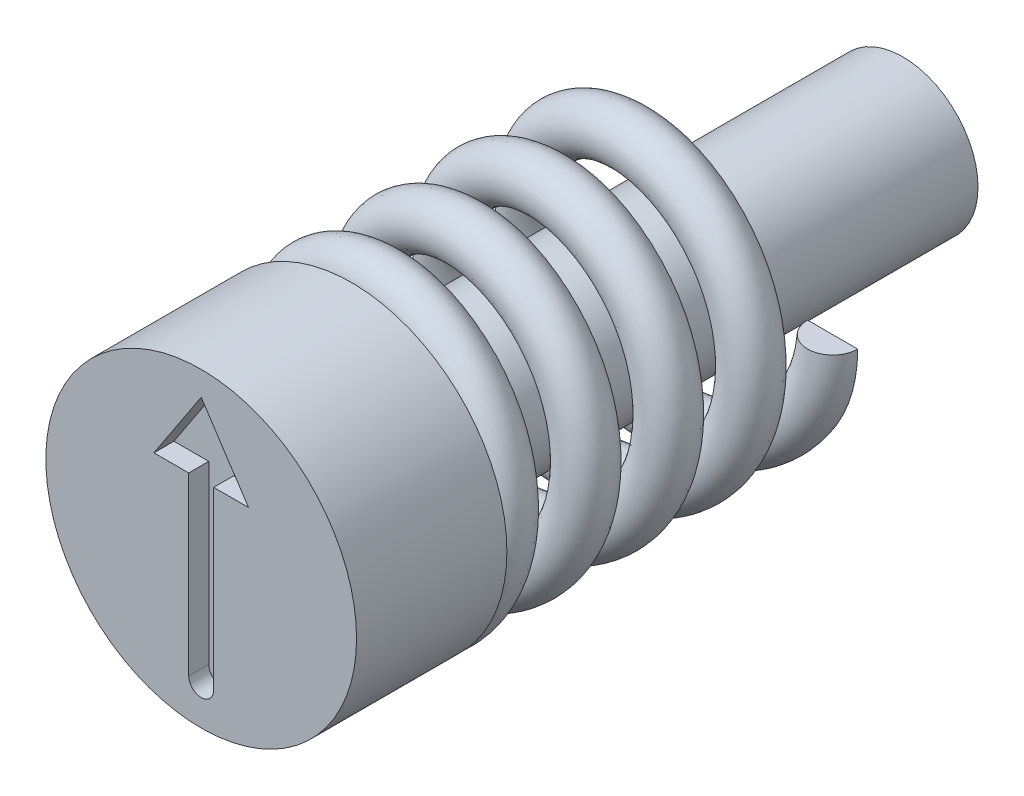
ISO-10303-21;
HEADER;
FILE_DESCRIPTION(('STEP AP214'),'2;1');
FILE_NAME('part.step','',(''),(''),'','','');
FILE_SCHEMA(('AUTOMOTIVE_DESIGN { 1 0 10303 214 1 1 1 1 }'));
ENDSEC;
DATA;
#1=APPLICATION_CONTEXT('core data for automotive mechanical design processes');
#2=APPLICATION_PROTOCOL_DEFINITION('international standard','automotive_design',2000,#1);
#3=PRODUCT_CONTEXT('',#1,'mechanical');
#4=PRODUCT('Part','Part','',(#3));
#5=PRODUCT_RELATED_PRODUCT_CATEGORY('part','',(#4));
#6=PRODUCT_DEFINITION_FORMATION('','',#4);
#7=PRODUCT_DEFINITION_CONTEXT('part definition',#1,'design');
#8=PRODUCT_DEFINITION('design','',#6,#7);
#9=PRODUCT_DEFINITION_SHAPE('','',#8);
#10=(LENGTH_UNIT() NAMED_UNIT(*) SI_UNIT(.MILLI.,.METRE.));
#11=(NAMED_UNIT(*) PLANE_ANGLE_UNIT() SI_UNIT($,.RADIAN.));
#12=(NAMED_UNIT(*) SI_UNIT($,.STERADIAN.) SOLID_ANGLE_UNIT());
#13=UNCERTAINTY_MEASURE_WITH_UNIT(LENGTH_MEASURE(1.E-05),#10,'distance_accuracy_value','');
#14=(GEOMETRIC_REPRESENTATION_CONTEXT(3) GLOBAL_UNCERTAINTY_ASSIGNED_CONTEXT((#13)) GLOBAL_UNIT_ASSIGNED_CONTEXT((#10,
#11,#12)) REPRESENTATION_CONTEXT('',''));
#15=CARTESIAN_POINT('',(0.,0.,0.));
#16=DIRECTION('',(0.,0.,1.));
#17=DIRECTION('',(1.,0.,0.));
#18=AXIS2_PLACEMENT_3D('',#15,#16,#17);
#19=CARTESIAN_POINT('',(2.6,0.,-10.5));
#20=DIRECTION('',(0.,-1.,0.));
#21=DIRECTION('',(0.,0.,-1.));
#22=AXIS2_PLACEMENT_3D('',#19,#20,#21);
#23=PLANE('',#22);
#24=CARTESIAN_POINT('',(2.6,0.,-10.));
#25=DIRECTION('',(0.,1.,0.));
#26=DIRECTION('',(0.,0.,1.));
#27=AXIS2_PLACEMENT_3D('',#24,#25,#26);
#28=CIRCLE('',#27,0.5);
#29=CARTESIAN_POINT('',(2.1,0.,-10.));
#30=VERTEX_POINT('',#29);
#31=CARTESIAN_POINT('',(3.1,0.,-10.));
#32=VERTEX_POINT('',#31);
#33=EDGE_CURVE('E88',#30,#32,#28,.T.);
#34=ORIENTED_EDGE('',*,*,#33,.T.);
#35=DIRECTION('',(-1.,0.,0.));
#36=VECTOR('',#35,1.);
#37=CARTESIAN_POINT('',(2.6,0.,-10.));
#38=LINE('',#37,#36);
#39=EDGE_CURVE('E75',#32,#30,#38,.T.);
#40=ORIENTED_EDGE('',*,*,#39,.T.);
#41=EDGE_LOOP('',(#34,#40));
#42=FACE_BOUND('',#41,.T.);
#43=ADVANCED_FACE('F49',(#42),#23,.F.);
#44=CARTESIAN_POINT('',(0.,-2.6,-3.5));
#45=DIRECTION('',(-1.,0.,0.));
#46=DIRECTION('',(0.,-1.,0.));
#47=AXIS2_PLACEMENT_3D('',#44,#45,#46);
#48=PLANE('',#47);
#49=DIRECTION('',(0.,-1.,0.));
#50=VECTOR('',#49,1.);
#51=CARTESIAN_POINT('',(0.,-2.6,-3.));
#52=LINE('',#51,#50);
#53=CARTESIAN_POINT('',(0.,-2.1,-3.));
#54=VERTEX_POINT('',#53);
#55=CARTESIAN_POINT('',(0.,-3.1,-3.));
#56=VERTEX_POINT('',#55);
#57=EDGE_CURVE('E69',#54,#56,#52,.T.);
#58=ORIENTED_EDGE('',*,*,#57,.F.);
#59=CARTESIAN_POINT('',(0.,-2.6,-3.));
#60=DIRECTION('',(-1.,0.,0.));
#61=DIRECTION('',(0.,-1.,0.));
#62=AXIS2_PLACEMENT_3D('',#59,#60,#61);
#63=CIRCLE('',#62,0.5);
#64=EDGE_CURVE('E85',#54,#56,#63,.T.);
#65=ORIENTED_EDGE('',*,*,#64,.T.);
#66=EDGE_LOOP('',(#58,#65));
#67=FACE_BOUND('',#66,.T.);
#68=ADVANCED_FACE('F51',(#67),#48,.T.);
#69=CARTESIAN_POINT('',(2.6,0.,-9.5));
#70=CARTESIAN_POINT('',(2.6,-1.07695526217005,-9.39705882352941));
#71=CARTESIAN_POINT('',(1.83847763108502,-1.83847763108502,-9.29411764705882));
#72=CARTESIAN_POINT('',(1.07695526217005,-2.6,-9.19117647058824));
#73=CARTESIAN_POINT('',(0.,-2.6,-9.08823529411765));
#74=CARTESIAN_POINT('',(-1.07695526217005,-2.6,-8.98529411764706));
#75=CARTESIAN_POINT('',(-1.83847763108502,-1.83847763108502,-8.88235294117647));
#76=CARTESIAN_POINT('',(-2.6,-1.07695526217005,-8.77941176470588));
#77=CARTESIAN_POINT('',(-2.6,0.,-8.6764705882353));
#78=CARTESIAN_POINT('',(-2.6,1.07695526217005,-8.57352941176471));
#79=CARTESIAN_POINT('',(-1.83847763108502,1.83847763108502,-8.47058823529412));
#80=CARTESIAN_POINT('',(-1.07695526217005,2.6,-8.36764705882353));
#81=CARTESIAN_POINT('',(0.,2.6,-8.26470588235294));
#82=CARTESIAN_POINT('',(1.07695526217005,2.6,-8.16176470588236));
#83=CARTESIAN_POINT('',(1.83847763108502,1.83847763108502,-8.05882352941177));
#84=CARTESIAN_POINT('',(2.6,1.07695526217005,-7.95588235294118));
#85=CARTESIAN_POINT('',(2.6,0.,-7.85294117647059));
#86=CARTESIAN_POINT('',(2.6,-1.07695526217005,-7.75));
#87=CARTESIAN_POINT('',(1.83847763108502,-1.83847763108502,-7.64705882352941));
#88=CARTESIAN_POINT('',(1.07695526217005,-2.6,-7.54411764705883));
#89=CARTESIAN_POINT('',(0.,-2.6,-7.44117647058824));
#90=CARTESIAN_POINT('',(-1.07695526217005,-2.6,-7.33823529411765));
#91=CARTESIAN_POINT('',(-1.83847763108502,-1.83847763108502,-7.23529411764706));
#92=CARTESIAN_POINT('',(-2.6,-1.07695526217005,-7.13235294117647));
#93=CARTESIAN_POINT('',(-2.6,0.,-7.02941176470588));
#94=CARTESIAN_POINT('',(-2.6,1.07695526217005,-6.9264705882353));
#95=CARTESIAN_POINT('',(-1.83847763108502,1.83847763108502,-6.82352941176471));
#96=CARTESIAN_POINT('',(-1.07695526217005,2.6,-6.72058823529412));
#97=CARTESIAN_POINT('',(0.,2.6,-6.61764705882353));
#98=CARTESIAN_POINT('',(1.07695526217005,2.6,-6.51470588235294));
#99=CARTESIAN_POINT('',(1.83847763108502,1.83847763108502,-6.41176470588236));
#100=CARTESIAN_POINT('',(2.6,1.07695526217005,-6.30882352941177));
#101=CARTESIAN_POINT('',(2.6,0.,-6.20588235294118));
#102=CARTESIAN_POINT('',(2.6,-1.07695526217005,-6.10294117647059));
#103=CARTESIAN_POINT('',(1.83847763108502,-1.83847763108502,-6.));
#104=CARTESIAN_POINT('',(1.07695526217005,-2.6,-5.89705882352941));
#105=CARTESIAN_POINT('',(0.,-2.6,-5.79411764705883));
#106=CARTESIAN_POINT('',(-1.07695526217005,-2.6,-5.69117647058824));
#107=CARTESIAN_POINT('',(-1.83847763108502,-1.83847763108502,-5.58823529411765));
#108=CARTESIAN_POINT('',(-2.6,-1.07695526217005,-5.48529411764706));
#109=CARTESIAN_POINT('',(-2.6,0.,-5.38235294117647));
#110=CARTESIAN_POINT('',(-2.6,1.07695526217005,-5.27941176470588));
#111=CARTESIAN_POINT('',(-1.83847763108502,1.83847763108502,-5.1764705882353));
#112=CARTESIAN_POINT('',(-1.07695526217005,2.6,-5.07352941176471));
#113=CARTESIAN_POINT('',(0.,2.6,-4.97058823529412));
#114=CARTESIAN_POINT('',(1.07695526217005,2.6,-4.86764705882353));
#115=CARTESIAN_POINT('',(1.83847763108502,1.83847763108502,-4.76470588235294));
#116=CARTESIAN_POINT('',(2.6,1.07695526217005,-4.66176470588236));
#117=CARTESIAN_POINT('',(2.6,0.,-4.55882352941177));
#118=CARTESIAN_POINT('',(2.6,-1.07695526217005,-4.45588235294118));
#119=CARTESIAN_POINT('',(1.83847763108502,-1.83847763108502,-4.35294117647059));
#120=CARTESIAN_POINT('',(1.07695526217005,-2.6,-4.25));
#121=CARTESIAN_POINT('',(0.,-2.6,-4.14705882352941));
#122=CARTESIAN_POINT('',(-1.07695526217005,-2.6,-4.04411764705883));
#123=CARTESIAN_POINT('',(-1.83847763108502,-1.83847763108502,-3.94117647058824));
#124=CARTESIAN_POINT('',(-2.6,-1.07695526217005,-3.83823529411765));
#125=CARTESIAN_POINT('',(-2.6,0.,-3.73529411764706));
#126=CARTESIAN_POINT('',(-2.6,1.07695526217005,-3.63235294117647));
#127=CARTESIAN_POINT('',(-1.83847763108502,1.83847763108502,-3.52941176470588));
#128=CARTESIAN_POINT('',(-1.07695526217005,2.6,-3.4264705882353));
#129=CARTESIAN_POINT('',(0.,2.6,-3.32352941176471));
#130=CARTESIAN_POINT('',(1.07695526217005,2.6,-3.22058823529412));
#131=CARTESIAN_POINT('',(1.83847763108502,1.83847763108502,-3.11764705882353));
#132=CARTESIAN_POINT('',(2.6,1.07695526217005,-3.01470588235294));
#133=CARTESIAN_POINT('',(2.6,0.,-2.91176470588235));
#134=CARTESIAN_POINT('',(2.6,-1.07695526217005,-2.80882352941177));
#135=CARTESIAN_POINT('',(1.83847763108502,-1.83847763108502,-2.70588235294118));
#136=CARTESIAN_POINT('',(1.07695526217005,-2.6,-2.60294117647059));
#137=CARTESIAN_POINT('',(0.,-2.6,-2.5));
#138=CARTESIAN_POINT('',(3.6,0.,-9.5));
#139=CARTESIAN_POINT('',(3.6,-1.49116882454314,-9.39705882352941));
#140=CARTESIAN_POINT('',(2.54558441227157,-2.54558441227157,-9.29411764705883));
#141=CARTESIAN_POINT('',(1.49116882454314,-3.6,-9.19117647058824));
#142=CARTESIAN_POINT('',(0.,-3.6,-9.08823529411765));
#143=CARTESIAN_POINT('',(-1.49116882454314,-3.6,-8.98529411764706));
#144=CARTESIAN_POINT('',(-2.54558441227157,-2.54558441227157,-8.88235294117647));
#145=CARTESIAN_POINT('',(-3.6,-1.49116882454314,-8.77941176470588));
#146=CARTESIAN_POINT('',(-3.6,0.,-8.6764705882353));
#147=CARTESIAN_POINT('',(-3.6,1.49116882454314,-8.57352941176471));
#148=CARTESIAN_POINT('',(-2.54558441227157,2.54558441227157,-8.47058823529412));
#149=CARTESIAN_POINT('',(-1.49116882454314,3.6,-8.36764705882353));
#150=CARTESIAN_POINT('',(0.,3.6,-8.26470588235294));
#151=CARTESIAN_POINT('',(1.49116882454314,3.6,-8.16176470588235));
#152=CARTESIAN_POINT('',(2.54558441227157,2.54558441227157,-8.05882352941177));
#153=CARTESIAN_POINT('',(3.6,1.49116882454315,-7.95588235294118));
#154=CARTESIAN_POINT('',(3.6,0.,-7.85294117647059));
#155=CARTESIAN_POINT('',(3.6,-1.49116882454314,-7.75));
#156=CARTESIAN_POINT('',(2.54558441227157,-2.54558441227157,-7.64705882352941));
#157=CARTESIAN_POINT('',(1.49116882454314,-3.6,-7.54411764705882));
#158=CARTESIAN_POINT('',(0.,-3.6,-7.44117647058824));
#159=CARTESIAN_POINT('',(-1.49116882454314,-3.6,-7.33823529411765));
#160=CARTESIAN_POINT('',(-2.54558441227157,-2.54558441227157,-7.23529411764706));
#161=CARTESIAN_POINT('',(-3.6,-1.49116882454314,-7.13235294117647));
#162=CARTESIAN_POINT('',(-3.6,0.,-7.02941176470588));
#163=CARTESIAN_POINT('',(-3.6,1.49116882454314,-6.92647058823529));
#164=CARTESIAN_POINT('',(-2.54558441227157,2.54558441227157,-6.82352941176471));
#165=CARTESIAN_POINT('',(-1.49116882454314,3.6,-6.72058823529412));
#166=CARTESIAN_POINT('',(0.,3.6,-6.61764705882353));
#167=CARTESIAN_POINT('',(1.49116882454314,3.6,-6.51470588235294));
#168=CARTESIAN_POINT('',(2.54558441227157,2.54558441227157,-6.41176470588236));
#169=CARTESIAN_POINT('',(3.6,1.49116882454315,-6.30882352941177));
#170=CARTESIAN_POINT('',(3.6,0.,-6.20588235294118));
#171=CARTESIAN_POINT('',(3.6,-1.49116882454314,-6.10294117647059));
#172=CARTESIAN_POINT('',(2.54558441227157,-2.54558441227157,-6.));
#173=CARTESIAN_POINT('',(1.49116882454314,-3.6,-5.89705882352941));
#174=CARTESIAN_POINT('',(0.,-3.6,-5.79411764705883));
#175=CARTESIAN_POINT('',(-1.49116882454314,-3.6,-5.69117647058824));
#176=CARTESIAN_POINT('',(-2.54558441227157,-2.54558441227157,-5.58823529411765));
#177=CARTESIAN_POINT('',(-3.6,-1.49116882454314,-5.48529411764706));
#178=CARTESIAN_POINT('',(-3.6,0.,-5.38235294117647));
#179=CARTESIAN_POINT('',(-3.6,1.49116882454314,-5.27941176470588));
#180=CARTESIAN_POINT('',(-2.54558441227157,2.54558441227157,-5.1764705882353));
#181=CARTESIAN_POINT('',(-1.49116882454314,3.6,-5.07352941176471));
#182=CARTESIAN_POINT('',(0.,3.6,-4.97058823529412));
#183=CARTESIAN_POINT('',(1.49116882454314,3.6,-4.86764705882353));
#184=CARTESIAN_POINT('',(2.54558441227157,2.54558441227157,-4.76470588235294));
#185=CARTESIAN_POINT('',(3.6,1.49116882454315,-4.66176470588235));
#186=CARTESIAN_POINT('',(3.6,0.,-4.55882352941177));
#187=CARTESIAN_POINT('',(3.6,-1.49116882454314,-4.45588235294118));
#188=CARTESIAN_POINT('',(2.54558441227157,-2.54558441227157,-4.35294117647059));
#189=CARTESIAN_POINT('',(1.49116882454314,-3.6,-4.25));
#190=CARTESIAN_POINT('',(0.,-3.6,-4.14705882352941));
#191=CARTESIAN_POINT('',(-1.49116882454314,-3.6,-4.04411764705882));
#192=CARTESIAN_POINT('',(-2.54558441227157,-2.54558441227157,-3.94117647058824));
#193=CARTESIAN_POINT('',(-3.6,-1.49116882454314,-3.83823529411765));
#194=CARTESIAN_POINT('',(-3.6,0.,-3.73529411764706));
#195=CARTESIAN_POINT('',(-3.6,1.49116882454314,-3.63235294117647));
#196=CARTESIAN_POINT('',(-2.54558441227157,2.54558441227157,-3.52941176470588));
#197=CARTESIAN_POINT('',(-1.49116882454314,3.6,-3.42647058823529));
#198=CARTESIAN_POINT('',(0.,3.6,-3.32352941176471));
#199=CARTESIAN_POINT('',(1.49116882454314,3.6,-3.22058823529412));
#200=CARTESIAN_POINT('',(2.54558441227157,2.54558441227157,-3.11764705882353));
#201=CARTESIAN_POINT('',(3.6,1.49116882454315,-3.01470588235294));
#202=CARTESIAN_POINT('',(3.6,0.,-2.91176470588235));
#203=CARTESIAN_POINT('',(3.6,-1.49116882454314,-2.80882352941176));
#204=CARTESIAN_POINT('',(2.54558441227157,-2.54558441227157,-2.70588235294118));
#205=CARTESIAN_POINT('',(1.49116882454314,-3.6,-2.60294117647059));
#206=CARTESIAN_POINT('',(0.,-3.6,-2.5));
#207=CARTESIAN_POINT('',(3.6,0.,-10.5));
#208=CARTESIAN_POINT('',(3.6,-1.49116882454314,-10.3970588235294));
#209=CARTESIAN_POINT('',(2.54558441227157,-2.54558441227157,-10.2941176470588));
#210=CARTESIAN_POINT('',(1.49116882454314,-3.6,-10.1911764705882));
#211=CARTESIAN_POINT('',(0.,-3.6,-10.0882352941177));
#212=CARTESIAN_POINT('',(-1.49116882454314,-3.6,-9.98529411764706));
#213=CARTESIAN_POINT('',(-2.54558441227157,-2.54558441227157,-9.88235294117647));
#214=CARTESIAN_POINT('',(-3.6,-1.49116882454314,-9.77941176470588));
#215=CARTESIAN_POINT('',(-3.6,0.,-9.6764705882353));
#216=CARTESIAN_POINT('',(-3.6,1.49116882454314,-9.57352941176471));
#217=CARTESIAN_POINT('',(-2.54558441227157,2.54558441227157,-9.47058823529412));
#218=CARTESIAN_POINT('',(-1.49116882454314,3.6,-9.36764705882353));
#219=CARTESIAN_POINT('',(0.,3.6,-9.26470588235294));
#220=CARTESIAN_POINT('',(1.49116882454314,3.6,-9.16176470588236));
#221=CARTESIAN_POINT('',(2.54558441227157,2.54558441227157,-9.05882352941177));
#222=CARTESIAN_POINT('',(3.6,1.49116882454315,-8.95588235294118));
#223=CARTESIAN_POINT('',(3.6,0.,-8.85294117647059));
#224=CARTESIAN_POINT('',(3.6,-1.49116882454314,-8.75));
#225=CARTESIAN_POINT('',(2.54558441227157,-2.54558441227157,-8.64705882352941));
#226=CARTESIAN_POINT('',(1.49116882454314,-3.6,-8.54411764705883));
#227=CARTESIAN_POINT('',(0.,-3.6,-8.44117647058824));
#228=CARTESIAN_POINT('',(-1.49116882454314,-3.6,-8.33823529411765));
#229=CARTESIAN_POINT('',(-2.54558441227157,-2.54558441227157,-8.23529411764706));
#230=CARTESIAN_POINT('',(-3.6,-1.49116882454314,-8.13235294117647));
#231=CARTESIAN_POINT('',(-3.6,0.,-8.02941176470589));
#232=CARTESIAN_POINT('',(-3.6,1.49116882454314,-7.9264705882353));
#233=CARTESIAN_POINT('',(-2.54558441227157,2.54558441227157,-7.82352941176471));
#234=CARTESIAN_POINT('',(-1.49116882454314,3.6,-7.72058823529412));
#235=CARTESIAN_POINT('',(0.,3.6,-7.61764705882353));
#236=CARTESIAN_POINT('',(1.49116882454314,3.6,-7.51470588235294));
#237=CARTESIAN_POINT('',(2.54558441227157,2.54558441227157,-7.41176470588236));
#238=CARTESIAN_POINT('',(3.6,1.49116882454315,-7.30882352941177));
#239=CARTESIAN_POINT('',(3.6,0.,-7.20588235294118));
#240=CARTESIAN_POINT('',(3.6,-1.49116882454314,-7.10294117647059));
#241=CARTESIAN_POINT('',(2.54558441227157,-2.54558441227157,-7.));
#242=CARTESIAN_POINT('',(1.49116882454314,-3.6,-6.89705882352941));
#243=CARTESIAN_POINT('',(0.,-3.6,-6.79411764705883));
#244=CARTESIAN_POINT('',(-1.49116882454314,-3.6,-6.69117647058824));
#245=CARTESIAN_POINT('',(-2.54558441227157,-2.54558441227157,-6.58823529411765));
#246=CARTESIAN_POINT('',(-3.6,-1.49116882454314,-6.48529411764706));
#247=CARTESIAN_POINT('',(-3.6,0.,-6.38235294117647));
#248=CARTESIAN_POINT('',(-3.6,1.49116882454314,-6.27941176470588));
#249=CARTESIAN_POINT('',(-2.54558441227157,2.54558441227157,-6.1764705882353));
#250=CARTESIAN_POINT('',(-1.49116882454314,3.6,-6.07352941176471));
#251=CARTESIAN_POINT('',(0.,3.6,-5.97058823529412));
#252=CARTESIAN_POINT('',(1.49116882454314,3.6,-5.86764705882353));
#253=CARTESIAN_POINT('',(2.54558441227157,2.54558441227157,-5.76470588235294));
#254=CARTESIAN_POINT('',(3.6,1.49116882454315,-5.66176470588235));
#255=CARTESIAN_POINT('',(3.6,0.,-5.55882352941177));
#256=CARTESIAN_POINT('',(3.6,-1.49116882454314,-5.45588235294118));
#257=CARTESIAN_POINT('',(2.54558441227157,-2.54558441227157,-5.35294117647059));
#258=CARTESIAN_POINT('',(1.49116882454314,-3.6,-5.25));
#259=CARTESIAN_POINT('',(0.,-3.6,-5.14705882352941));
#260=CARTESIAN_POINT('',(-1.49116882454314,-3.6,-5.04411764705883));
#261=CARTESIAN_POINT('',(-2.54558441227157,-2.54558441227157,-4.94117647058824));
#262=CARTESIAN_POINT('',(-3.6,-1.49116882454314,-4.83823529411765));
#263=CARTESIAN_POINT('',(-3.6,0.,-4.73529411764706));
#264=CARTESIAN_POINT('',(-3.6,1.49116882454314,-4.63235294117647));
#265=CARTESIAN_POINT('',(-2.54558441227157,2.54558441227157,-4.52941176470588));
#266=CARTESIAN_POINT('',(-1.49116882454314,3.6,-4.4264705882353));
#267=CARTESIAN_POINT('',(0.,3.6,-4.32352941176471));
#268=CARTESIAN_POINT('',(1.49116882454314,3.6,-4.22058823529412));
#269=CARTESIAN_POINT('',(2.54558441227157,2.54558441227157,-4.11764705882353));
#270=CARTESIAN_POINT('',(3.6,1.49116882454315,-4.01470588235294));
#271=CARTESIAN_POINT('',(3.6,0.,-3.91176470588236));
#272=CARTESIAN_POINT('',(3.6,-1.49116882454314,-3.80882352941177));
#273=CARTESIAN_POINT('',(2.54558441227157,-2.54558441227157,-3.70588235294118));
#274=CARTESIAN_POINT('',(1.49116882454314,-3.6,-3.60294117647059));
#275=CARTESIAN_POINT('',(0.,-3.6,-3.5));
#276=CARTESIAN_POINT('',(2.6,0.,-10.5));
#277=CARTESIAN_POINT('',(2.6,-1.07695526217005,-10.3970588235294));
#278=CARTESIAN_POINT('',(1.83847763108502,-1.83847763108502,-10.2941176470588));
#279=CARTESIAN_POINT('',(1.07695526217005,-2.6,-10.1911764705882));
#280=CARTESIAN_POINT('',(0.,-2.6,-10.0882352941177));
#281=CARTESIAN_POINT('',(-1.07695526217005,-2.6,-9.98529411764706));
#282=CARTESIAN_POINT('',(-1.83847763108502,-1.83847763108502,-9.88235294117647));
#283=CARTESIAN_POINT('',(-2.6,-1.07695526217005,-9.77941176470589));
#284=CARTESIAN_POINT('',(-2.6,0.,-9.6764705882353));
#285=CARTESIAN_POINT('',(-2.6,1.07695526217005,-9.57352941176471));
#286=CARTESIAN_POINT('',(-1.83847763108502,1.83847763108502,-9.47058823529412));
#287=CARTESIAN_POINT('',(-1.07695526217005,2.6,-9.36764705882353));
#288=CARTESIAN_POINT('',(0.,2.6,-9.26470588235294));
#289=CARTESIAN_POINT('',(1.07695526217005,2.6,-9.16176470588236));
#290=CARTESIAN_POINT('',(1.83847763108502,1.83847763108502,-9.05882352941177));
#291=CARTESIAN_POINT('',(2.6,1.07695526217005,-8.95588235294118));
#292=CARTESIAN_POINT('',(2.6,0.,-8.85294117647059));
#293=CARTESIAN_POINT('',(2.6,-1.07695526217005,-8.75));
#294=CARTESIAN_POINT('',(1.83847763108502,-1.83847763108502,-8.64705882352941));
#295=CARTESIAN_POINT('',(1.07695526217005,-2.6,-8.54411764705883));
#296=CARTESIAN_POINT('',(0.,-2.6,-8.44117647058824));
#297=CARTESIAN_POINT('',(-1.07695526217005,-2.6,-8.33823529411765));
#298=CARTESIAN_POINT('',(-1.83847763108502,-1.83847763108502,-8.23529411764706));
#299=CARTESIAN_POINT('',(-2.6,-1.07695526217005,-8.13235294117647));
#300=CARTESIAN_POINT('',(-2.6,0.,-8.02941176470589));
#301=CARTESIAN_POINT('',(-2.6,1.07695526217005,-7.9264705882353));
#302=CARTESIAN_POINT('',(-1.83847763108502,1.83847763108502,-7.82352941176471));
#303=CARTESIAN_POINT('',(-1.07695526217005,2.6,-7.72058823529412));
#304=CARTESIAN_POINT('',(0.,2.6,-7.61764705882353));
#305=CARTESIAN_POINT('',(1.07695526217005,2.6,-7.51470588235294));
#306=CARTESIAN_POINT('',(1.83847763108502,1.83847763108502,-7.41176470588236));
#307=CARTESIAN_POINT('',(2.6,1.07695526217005,-7.30882352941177));
#308=CARTESIAN_POINT('',(2.6,0.,-7.20588235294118));
#309=CARTESIAN_POINT('',(2.6,-1.07695526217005,-7.10294117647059));
#310=CARTESIAN_POINT('',(1.83847763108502,-1.83847763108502,-7.));
#311=CARTESIAN_POINT('',(1.07695526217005,-2.6,-6.89705882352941));
#312=CARTESIAN_POINT('',(0.,-2.6,-6.79411764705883));
#313=CARTESIAN_POINT('',(-1.07695526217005,-2.6,-6.69117647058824));
#314=CARTESIAN_POINT('',(-1.83847763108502,-1.83847763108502,-6.58823529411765));
#315=CARTESIAN_POINT('',(-2.6,-1.07695526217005,-6.48529411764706));
#316=CARTESIAN_POINT('',(-2.6,0.,-6.38235294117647));
#317=CARTESIAN_POINT('',(-2.6,1.07695526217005,-6.27941176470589));
#318=CARTESIAN_POINT('',(-1.83847763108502,1.83847763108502,-6.1764705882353));
#319=CARTESIAN_POINT('',(-1.07695526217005,2.6,-6.07352941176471));
#320=CARTESIAN_POINT('',(0.,2.6,-5.97058823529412));
#321=CARTESIAN_POINT('',(1.07695526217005,2.6,-5.86764705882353));
#322=CARTESIAN_POINT('',(1.83847763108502,1.83847763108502,-5.76470588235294));
#323=CARTESIAN_POINT('',(2.6,1.07695526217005,-5.66176470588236));
#324=CARTESIAN_POINT('',(2.6,0.,-5.55882352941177));
#325=CARTESIAN_POINT('',(2.6,-1.07695526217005,-5.45588235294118));
#326=CARTESIAN_POINT('',(1.83847763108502,-1.83847763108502,-5.35294117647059));
#327=CARTESIAN_POINT('',(1.07695526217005,-2.6,-5.25));
#328=CARTESIAN_POINT('',(0.,-2.6,-5.14705882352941));
#329=CARTESIAN_POINT('',(-1.07695526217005,-2.6,-5.04411764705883));
#330=CARTESIAN_POINT('',(-1.83847763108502,-1.83847763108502,-4.94117647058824));
#331=CARTESIAN_POINT('',(-2.6,-1.07695526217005,-4.83823529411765));
#332=CARTESIAN_POINT('',(-2.6,0.,-4.73529411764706));
#333=CARTESIAN_POINT('',(-2.6,1.07695526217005,-4.63235294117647));
#334=CARTESIAN_POINT('',(-1.83847763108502,1.83847763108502,-4.52941176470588));
#335=CARTESIAN_POINT('',(-1.07695526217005,2.6,-4.4264705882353));
#336=CARTESIAN_POINT('',(0.,2.6,-4.32352941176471));
#337=CARTESIAN_POINT('',(1.07695526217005,2.6,-4.22058823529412));
#338=CARTESIAN_POINT('',(1.83847763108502,1.83847763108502,-4.11764705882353));
#339=CARTESIAN_POINT('',(2.6,1.07695526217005,-4.01470588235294));
#340=CARTESIAN_POINT('',(2.6,0.,-3.91176470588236));
#341=CARTESIAN_POINT('',(2.6,-1.07695526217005,-3.80882352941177));
#342=CARTESIAN_POINT('',(1.83847763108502,-1.83847763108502,-3.70588235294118));
#343=CARTESIAN_POINT('',(1.07695526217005,-2.6,-3.60294117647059));
#344=CARTESIAN_POINT('',(0.,-2.6,-3.5));
#345=CARTESIAN_POINT('',(1.6,0.,-10.5));
#346=CARTESIAN_POINT('',(1.6,-0.662741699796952,-10.3970588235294));
#347=CARTESIAN_POINT('',(1.13137084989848,-1.13137084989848,-10.2941176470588));
#348=CARTESIAN_POINT('',(0.662741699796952,-1.6,-10.1911764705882));
#349=CARTESIAN_POINT('',(0.,-1.6,-10.0882352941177));
#350=CARTESIAN_POINT('',(-0.662741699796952,-1.6,-9.98529411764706));
#351=CARTESIAN_POINT('',(-1.13137084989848,-1.13137084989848,-9.88235294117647));
#352=CARTESIAN_POINT('',(-1.6,-0.662741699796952,-9.77941176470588));
#353=CARTESIAN_POINT('',(-1.6,0.,-9.6764705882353));
#354=CARTESIAN_POINT('',(-1.6,0.662741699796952,-9.57352941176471));
#355=CARTESIAN_POINT('',(-1.13137084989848,1.13137084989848,-9.47058823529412));
#356=CARTESIAN_POINT('',(-0.662741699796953,1.6,-9.36764705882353));
#357=CARTESIAN_POINT('',(0.,1.6,-9.26470588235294));
#358=CARTESIAN_POINT('',(0.662741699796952,1.6,-9.16176470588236));
#359=CARTESIAN_POINT('',(1.13137084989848,1.13137084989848,-9.05882352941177));
#360=CARTESIAN_POINT('',(1.6,0.662741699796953,-8.95588235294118));
#361=CARTESIAN_POINT('',(1.6,0.,-8.85294117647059));
#362=CARTESIAN_POINT('',(1.6,-0.662741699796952,-8.75));
#363=CARTESIAN_POINT('',(1.13137084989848,-1.13137084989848,-8.64705882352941));
#364=CARTESIAN_POINT('',(0.662741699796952,-1.6,-8.54411764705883));
#365=CARTESIAN_POINT('',(0.,-1.6,-8.44117647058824));
#366=CARTESIAN_POINT('',(-0.662741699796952,-1.6,-8.33823529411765));
#367=CARTESIAN_POINT('',(-1.13137084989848,-1.13137084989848,-8.23529411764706));
#368=CARTESIAN_POINT('',(-1.6,-0.662741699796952,-8.13235294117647));
#369=CARTESIAN_POINT('',(-1.6,0.,-8.02941176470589));
#370=CARTESIAN_POINT('',(-1.6,0.662741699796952,-7.9264705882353));
#371=CARTESIAN_POINT('',(-1.13137084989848,1.13137084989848,-7.82352941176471));
#372=CARTESIAN_POINT('',(-0.662741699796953,1.6,-7.72058823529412));
#373=CARTESIAN_POINT('',(0.,1.6,-7.61764705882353));
#374=CARTESIAN_POINT('',(0.662741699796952,1.6,-7.51470588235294));
#375=CARTESIAN_POINT('',(1.13137084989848,1.13137084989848,-7.41176470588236));
#376=CARTESIAN_POINT('',(1.6,0.662741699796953,-7.30882352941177));
#377=CARTESIAN_POINT('',(1.6,0.,-7.20588235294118));
#378=CARTESIAN_POINT('',(1.6,-0.662741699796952,-7.10294117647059));
#379=CARTESIAN_POINT('',(1.13137084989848,-1.13137084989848,-7.));
#380=CARTESIAN_POINT('',(0.662741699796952,-1.6,-6.89705882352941));
#381=CARTESIAN_POINT('',(0.,-1.6,-6.79411764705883));
#382=CARTESIAN_POINT('',(-0.662741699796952,-1.6,-6.69117647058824));
#383=CARTESIAN_POINT('',(-1.13137084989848,-1.13137084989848,-6.58823529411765));
#384=CARTESIAN_POINT('',(-1.6,-0.662741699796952,-6.48529411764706));
#385=CARTESIAN_POINT('',(-1.6,0.,-6.38235294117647));
#386=CARTESIAN_POINT('',(-1.6,0.662741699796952,-6.27941176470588));
#387=CARTESIAN_POINT('',(-1.13137084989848,1.13137084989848,-6.1764705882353));
#388=CARTESIAN_POINT('',(-0.662741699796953,1.6,-6.07352941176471));
#389=CARTESIAN_POINT('',(0.,1.6,-5.97058823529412));
#390=CARTESIAN_POINT('',(0.662741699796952,1.6,-5.86764705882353));
#391=CARTESIAN_POINT('',(1.13137084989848,1.13137084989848,-5.76470588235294));
#392=CARTESIAN_POINT('',(1.6,0.662741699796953,-5.66176470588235));
#393=CARTESIAN_POINT('',(1.6,0.,-5.55882352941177));
#394=CARTESIAN_POINT('',(1.6,-0.662741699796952,-5.45588235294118));
#395=CARTESIAN_POINT('',(1.13137084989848,-1.13137084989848,-5.35294117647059));
#396=CARTESIAN_POINT('',(0.662741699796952,-1.6,-5.25));
#397=CARTESIAN_POINT('',(0.,-1.6,-5.14705882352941));
#398=CARTESIAN_POINT('',(-0.662741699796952,-1.6,-5.04411764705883));
#399=CARTESIAN_POINT('',(-1.13137084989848,-1.13137084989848,-4.94117647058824));
#400=CARTESIAN_POINT('',(-1.6,-0.662741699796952,-4.83823529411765));
#401=CARTESIAN_POINT('',(-1.6,0.,-4.73529411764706));
#402=CARTESIAN_POINT('',(-1.6,0.662741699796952,-4.63235294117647));
#403=CARTESIAN_POINT('',(-1.13137084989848,1.13137084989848,-4.52941176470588));
#404=CARTESIAN_POINT('',(-0.662741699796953,1.6,-4.4264705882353));
#405=CARTESIAN_POINT('',(0.,1.6,-4.32352941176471));
#406=CARTESIAN_POINT('',(0.662741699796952,1.6,-4.22058823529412));
#407=CARTESIAN_POINT('',(1.13137084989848,1.13137084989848,-4.11764705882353));
#408=CARTESIAN_POINT('',(1.6,0.662741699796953,-4.01470588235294));
#409=CARTESIAN_POINT('',(1.6,0.,-3.91176470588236));
#410=CARTESIAN_POINT('',(1.6,-0.662741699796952,-3.80882352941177));
#411=CARTESIAN_POINT('',(1.13137084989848,-1.13137084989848,-3.70588235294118));
#412=CARTESIAN_POINT('',(0.662741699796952,-1.6,-3.60294117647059));
#413=CARTESIAN_POINT('',(0.,-1.6,-3.5));
#414=CARTESIAN_POINT('',(1.6,0.,-9.5));
#415=CARTESIAN_POINT('',(1.6,-0.662741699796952,-9.39705882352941));
#416=CARTESIAN_POINT('',(1.13137084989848,-1.13137084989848,-9.29411764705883));
#417=CARTESIAN_POINT('',(0.662741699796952,-1.6,-9.19117647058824));
#418=CARTESIAN_POINT('',(0.,-1.6,-9.08823529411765));
#419=CARTESIAN_POINT('',(-0.662741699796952,-1.6,-8.98529411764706));
#420=CARTESIAN_POINT('',(-1.13137084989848,-1.13137084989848,-8.88235294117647));
#421=CARTESIAN_POINT('',(-1.6,-0.662741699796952,-8.77941176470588));
#422=CARTESIAN_POINT('',(-1.6,0.,-8.6764705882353));
#423=CARTESIAN_POINT('',(-1.6,0.662741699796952,-8.57352941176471));
#424=CARTESIAN_POINT('',(-1.13137084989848,1.13137084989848,-8.47058823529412));
#425=CARTESIAN_POINT('',(-0.662741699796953,1.6,-8.36764705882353));
#426=CARTESIAN_POINT('',(0.,1.6,-8.26470588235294));
#427=CARTESIAN_POINT('',(0.662741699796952,1.6,-8.16176470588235));
#428=CARTESIAN_POINT('',(1.13137084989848,1.13137084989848,-8.05882352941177));
#429=CARTESIAN_POINT('',(1.6,0.662741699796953,-7.95588235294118));
#430=CARTESIAN_POINT('',(1.6,0.,-7.85294117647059));
#431=CARTESIAN_POINT('',(1.6,-0.662741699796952,-7.75));
#432=CARTESIAN_POINT('',(1.13137084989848,-1.13137084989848,-7.64705882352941));
#433=CARTESIAN_POINT('',(0.662741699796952,-1.6,-7.54411764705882));
#434=CARTESIAN_POINT('',(0.,-1.6,-7.44117647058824));
#435=CARTESIAN_POINT('',(-0.662741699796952,-1.6,-7.33823529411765));
#436=CARTESIAN_POINT('',(-1.13137084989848,-1.13137084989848,-7.23529411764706));
#437=CARTESIAN_POINT('',(-1.6,-0.662741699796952,-7.13235294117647));
#438=CARTESIAN_POINT('',(-1.6,0.,-7.02941176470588));
#439=CARTESIAN_POINT('',(-1.6,0.662741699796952,-6.92647058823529));
#440=CARTESIAN_POINT('',(-1.13137084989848,1.13137084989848,-6.82352941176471));
#441=CARTESIAN_POINT('',(-0.662741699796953,1.6,-6.72058823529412));
#442=CARTESIAN_POINT('',(0.,1.6,-6.61764705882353));
#443=CARTESIAN_POINT('',(0.662741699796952,1.6,-6.51470588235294));
#444=CARTESIAN_POINT('',(1.13137084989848,1.13137084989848,-6.41176470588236));
#445=CARTESIAN_POINT('',(1.6,0.662741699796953,-6.30882352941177));
#446=CARTESIAN_POINT('',(1.6,0.,-6.20588235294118));
#447=CARTESIAN_POINT('',(1.6,-0.662741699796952,-6.10294117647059));
#448=CARTESIAN_POINT('',(1.13137084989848,-1.13137084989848,-6.));
#449=CARTESIAN_POINT('',(0.662741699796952,-1.6,-5.89705882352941));
#450=CARTESIAN_POINT('',(0.,-1.6,-5.79411764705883));
#451=CARTESIAN_POINT('',(-0.662741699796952,-1.6,-5.69117647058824));
#452=CARTESIAN_POINT('',(-1.13137084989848,-1.13137084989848,-5.58823529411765));
#453=CARTESIAN_POINT('',(-1.6,-0.662741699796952,-5.48529411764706));
#454=CARTESIAN_POINT('',(-1.6,0.,-5.38235294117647));
#455=CARTESIAN_POINT('',(-1.6,0.662741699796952,-5.27941176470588));
#456=CARTESIAN_POINT('',(-1.13137084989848,1.13137084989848,-5.1764705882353));
#457=CARTESIAN_POINT('',(-0.662741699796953,1.6,-5.07352941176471));
#458=CARTESIAN_POINT('',(0.,1.6,-4.97058823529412));
#459=CARTESIAN_POINT('',(0.662741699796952,1.6,-4.86764705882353));
#460=CARTESIAN_POINT('',(1.13137084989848,1.13137084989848,-4.76470588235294));
#461=CARTESIAN_POINT('',(1.6,0.662741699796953,-4.66176470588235));
#462=CARTESIAN_POINT('',(1.6,0.,-4.55882352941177));
#463=CARTESIAN_POINT('',(1.6,-0.662741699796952,-4.45588235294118));
#464=CARTESIAN_POINT('',(1.13137084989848,-1.13137084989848,-4.35294117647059));
#465=CARTESIAN_POINT('',(0.662741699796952,-1.6,-4.25));
#466=CARTESIAN_POINT('',(0.,-1.6,-4.14705882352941));
#467=CARTESIAN_POINT('',(-0.662741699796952,-1.6,-4.04411764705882));
#468=CARTESIAN_POINT('',(-1.13137084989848,-1.13137084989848,-3.94117647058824));
#469=CARTESIAN_POINT('',(-1.6,-0.662741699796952,-3.83823529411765));
#470=CARTESIAN_POINT('',(-1.6,0.,-3.73529411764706));
#471=CARTESIAN_POINT('',(-1.6,0.662741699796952,-3.63235294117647));
#472=CARTESIAN_POINT('',(-1.13137084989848,1.13137084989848,-3.52941176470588));
#473=CARTESIAN_POINT('',(-0.662741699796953,1.6,-3.42647058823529));
#474=CARTESIAN_POINT('',(0.,1.6,-3.32352941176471));
#475=CARTESIAN_POINT('',(0.662741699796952,1.6,-3.22058823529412));
#476=CARTESIAN_POINT('',(1.13137084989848,1.13137084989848,-3.11764705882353));
#477=CARTESIAN_POINT('',(1.6,0.662741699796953,-3.01470588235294));
#478=CARTESIAN_POINT('',(1.6,0.,-2.91176470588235));
#479=CARTESIAN_POINT('',(1.6,-0.662741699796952,-2.80882352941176));
#480=CARTESIAN_POINT('',(1.13137084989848,-1.13137084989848,-2.70588235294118));
#481=CARTESIAN_POINT('',(0.662741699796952,-1.6,-2.60294117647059));
#482=CARTESIAN_POINT('',(0.,-1.6,-2.5));
#483=CARTESIAN_POINT('',(2.6,0.,-9.5));
#484=CARTESIAN_POINT('',(2.6,-1.07695526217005,-9.39705882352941));
#485=CARTESIAN_POINT('',(1.83847763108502,-1.83847763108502,-9.29411764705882));
#486=CARTESIAN_POINT('',(1.07695526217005,-2.6,-9.19117647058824));
#487=CARTESIAN_POINT('',(0.,-2.6,-9.08823529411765));
#488=CARTESIAN_POINT('',(-1.07695526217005,-2.6,-8.98529411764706));
#489=CARTESIAN_POINT('',(-1.83847763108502,-1.83847763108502,-8.88235294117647));
#490=CARTESIAN_POINT('',(-2.6,-1.07695526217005,-8.77941176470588));
#491=CARTESIAN_POINT('',(-2.6,0.,-8.6764705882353));
#492=CARTESIAN_POINT('',(-2.6,1.07695526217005,-8.57352941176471));
#493=CARTESIAN_POINT('',(-1.83847763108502,1.83847763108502,-8.47058823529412));
#494=CARTESIAN_POINT('',(-1.07695526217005,2.6,-8.36764705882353));
#495=CARTESIAN_POINT('',(0.,2.6,-8.26470588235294));
#496=CARTESIAN_POINT('',(1.07695526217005,2.6,-8.16176470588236));
#497=CARTESIAN_POINT('',(1.83847763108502,1.83847763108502,-8.05882352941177));
#498=CARTESIAN_POINT('',(2.6,1.07695526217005,-7.95588235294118));
#499=CARTESIAN_POINT('',(2.6,0.,-7.85294117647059));
#500=CARTESIAN_POINT('',(2.6,-1.07695526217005,-7.75));
#501=CARTESIAN_POINT('',(1.83847763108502,-1.83847763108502,-7.64705882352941));
#502=CARTESIAN_POINT('',(1.07695526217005,-2.6,-7.54411764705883));
#503=CARTESIAN_POINT('',(0.,-2.6,-7.44117647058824));
#504=CARTESIAN_POINT('',(-1.07695526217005,-2.6,-7.33823529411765));
#505=CARTESIAN_POINT('',(-1.83847763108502,-1.83847763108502,-7.23529411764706));
#506=CARTESIAN_POINT('',(-2.6,-1.07695526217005,-7.13235294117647));
#507=CARTESIAN_POINT('',(-2.6,0.,-7.02941176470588));
#508=CARTESIAN_POINT('',(-2.6,1.07695526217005,-6.9264705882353));
#509=CARTESIAN_POINT('',(-1.83847763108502,1.83847763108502,-6.82352941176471));
#510=CARTESIAN_POINT('',(-1.07695526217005,2.6,-6.72058823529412));
#511=CARTESIAN_POINT('',(0.,2.6,-6.61764705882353));
#512=CARTESIAN_POINT('',(1.07695526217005,2.6,-6.51470588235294));
#513=CARTESIAN_POINT('',(1.83847763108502,1.83847763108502,-6.41176470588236));
#514=CARTESIAN_POINT('',(2.6,1.07695526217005,-6.30882352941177));
#515=CARTESIAN_POINT('',(2.6,0.,-6.20588235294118));
#516=CARTESIAN_POINT('',(2.6,-1.07695526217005,-6.10294117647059));
#517=CARTESIAN_POINT('',(1.83847763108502,-1.83847763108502,-6.));
#518=CARTESIAN_POINT('',(1.07695526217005,-2.6,-5.89705882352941));
#519=CARTESIAN_POINT('',(0.,-2.6,-5.79411764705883));
#520=CARTESIAN_POINT('',(-1.07695526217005,-2.6,-5.69117647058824));
#521=CARTESIAN_POINT('',(-1.83847763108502,-1.83847763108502,-5.58823529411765));
#522=CARTESIAN_POINT('',(-2.6,-1.07695526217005,-5.48529411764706));
#523=CARTESIAN_POINT('',(-2.6,0.,-5.38235294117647));
#524=CARTESIAN_POINT('',(-2.6,1.07695526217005,-5.27941176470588));
#525=CARTESIAN_POINT('',(-1.83847763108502,1.83847763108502,-5.1764705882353));
#526=CARTESIAN_POINT('',(-1.07695526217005,2.6,-5.07352941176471));
#527=CARTESIAN_POINT('',(0.,2.6,-4.97058823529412));
#528=CARTESIAN_POINT('',(1.07695526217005,2.6,-4.86764705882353));
#529=CARTESIAN_POINT('',(1.83847763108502,1.83847763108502,-4.76470588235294));
#530=CARTESIAN_POINT('',(2.6,1.07695526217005,-4.66176470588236));
#531=CARTESIAN_POINT('',(2.6,0.,-4.55882352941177));
#532=CARTESIAN_POINT('',(2.6,-1.07695526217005,-4.45588235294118));
#533=CARTESIAN_POINT('',(1.83847763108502,-1.83847763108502,-4.35294117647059));
#534=CARTESIAN_POINT('',(1.07695526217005,-2.6,-4.25));
#535=CARTESIAN_POINT('',(0.,-2.6,-4.14705882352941));
#536=CARTESIAN_POINT('',(-1.07695526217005,-2.6,-4.04411764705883));
#537=CARTESIAN_POINT('',(-1.83847763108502,-1.83847763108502,-3.94117647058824));
#538=CARTESIAN_POINT('',(-2.6,-1.07695526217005,-3.83823529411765));
#539=CARTESIAN_POINT('',(-2.6,0.,-3.73529411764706));
#540=CARTESIAN_POINT('',(-2.6,1.07695526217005,-3.63235294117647));
#541=CARTESIAN_POINT('',(-1.83847763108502,1.83847763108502,-3.52941176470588));
#542=CARTESIAN_POINT('',(-1.07695526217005,2.6,-3.4264705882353));
#543=CARTESIAN_POINT('',(0.,2.6,-3.32352941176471));
#544=CARTESIAN_POINT('',(1.07695526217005,2.6,-3.22058823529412));
#545=CARTESIAN_POINT('',(1.83847763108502,1.83847763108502,-3.11764705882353));
#546=CARTESIAN_POINT('',(2.6,1.07695526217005,-3.01470588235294));
#547=CARTESIAN_POINT('',(2.6,0.,-2.91176470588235));
#548=CARTESIAN_POINT('',(2.6,-1.07695526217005,-2.80882352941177));
#549=CARTESIAN_POINT('',(1.83847763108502,-1.83847763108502,-2.70588235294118));
#550=CARTESIAN_POINT('',(1.07695526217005,-2.6,-2.60294117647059));
#551=CARTESIAN_POINT('',(0.,-2.6,-2.5));
#552=(BOUNDED_SURFACE() B_SPLINE_SURFACE(3,2,((#69,#70,#71,#72,#73,#74,#75,#76,#77,#78,#79,#80,
#81,#82,#83,#84,#85,#86,#87,#88,#89,#90,#91,#92,#93,#94,#95,#96,#97,#98,#99,#100,#101,#102,#103,
#104,#105,#106,#107,#108,#109,#110,#111,#112,#113,#114,#115,#116,#117,#118,#119,#120,#121,#122,
#123,#124,#125,#126,#127,#128,#129,#130,#131,#132,#133,#134,#135,#136,#137),(#138,#139,#140,
#141,#142,#143,#144,#145,#146,#147,#148,#149,#150,#151,#152,#153,#154,#155,#156,#157,#158,#159,
#160,#161,#162,#163,#164,#165,#166,#167,#168,#169,#170,#171,#172,#173,#174,#175,#176,#177,#178,
#179,#180,#181,#182,#183,#184,#185,#186,#187,#188,#189,#190,#191,#192,#193,#194,#195,#196,#197,
#198,#199,#200,#201,#202,#203,#204,#205,#206),(#207,#208,#209,#210,#211,#212,#213,#214,#215,
#216,#217,#218,#219,#220,#221,#222,#223,#224,#225,#226,#227,#228,#229,#230,#231,#232,#233,#234,
#235,#236,#237,#238,#239,#240,#241,#242,#243,#244,#245,#246,#247,#248,#249,#250,#251,#252,#253,
#254,#255,#256,#257,#258,#259,#260,#261,#262,#263,#264,#265,#266,#267,#268,#269,#270,#271,#272,
#273,#274,#275),(#276,#277,#278,#279,#280,#281,#282,#283,#284,#285,#286,#287,#288,#289,#290,
#291,#292,#293,#294,#295,#296,#297,#298,#299,#300,#301,#302,#303,#304,#305,#306,#307,#308,#309,
#310,#311,#312,#313,#314,#315,#316,#317,#318,#319,#320,#321,#322,#323,#324,#325,#326,#327,#328,
#329,#330,#331,#332,#333,#334,#335,#336,#337,#338,#339,#340,#341,#342,#343,#344),(#345,#346,
#347,#348,#349,#350,#351,#352,#353,#354,#355,#356,#357,#358,#359,#360,#361,#362,#363,#364,#365,
#366,#367,#368,#369,#370,#371,#372,#373,#374,#375,#376,#377,#378,#379,#380,#381,#382,#383,#384,
#385,#386,#387,#388,#389,#390,#391,#392,#393,#394,#395,#396,#397,#398,#399,#400,#401,#402,#403,
#404,#405,#406,#407,#408,#409,#410,#411,#412,#413),(#414,#415,#416,#417,#418,#419,#420,#421,
#422,#423,#424,#425,#426,#427,#428,#429,#430,#431,#432,#433,#434,#435,#436,#437,#438,#439,#440,
#441,#442,#443,#444,#445,#446,#447,#448,#449,#450,#451,#452,#453,#454,#455,#456,#457,#458,#459,
#460,#461,#462,#463,#464,#465,#466,#467,#468,#469,#470,#471,#472,#473,#474,#475,#476,#477,#478,
#479,#480,#481,#482),(#483,#484,#485,#486,#487,#488,#489,#490,#491,#492,#493,#494,#495,#496,
#497,#498,#499,#500,#501,#502,#503,#504,#505,#506,#507,#508,#509,#510,#511,#512,#513,#514,#515,
#516,#517,#518,#519,#520,#521,#522,#523,#524,#525,#526,#527,#528,#529,#530,#531,#532,#533,#534,
#535,#536,#537,#538,#539,#540,#541,#542,#543,#544,#545,#546,#547,#548,#549,#550,#551)),
.UNSPECIFIED.,.T.,.F.,.F.) B_SPLINE_SURFACE_WITH_KNOTS((4,3,4),(3,2,2,2,2,2,2,2,2,2,2,2,2,2,2,2,
2,2,2,2,2,2,2,2,2,2,2,2,2,2,2,2,2,2,3),(0.,0.5,1.),(0.,0.025,0.05,0.075,0.1,0.125,0.15,0.175,
0.2,0.225,0.25,0.275,0.3,0.325,0.35,0.375,0.4,0.425,0.45,0.475,0.5,0.525,0.55,0.575,0.6,0.625,
0.65,0.675,0.7,0.725,0.75,0.775,0.8,0.825,0.85),
.UNSPECIFIED.) GEOMETRIC_REPRESENTATION_ITEM() RATIONAL_B_SPLINE_SURFACE(((1.,0.923879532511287,
1.,0.923879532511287,1.,0.923879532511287,1.,0.923879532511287,1.,0.923879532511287,1.,
0.923879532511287,1.,0.923879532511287,1.,0.923879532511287,1.,0.923879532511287,1.,
0.923879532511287,1.,0.923879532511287,1.,0.923879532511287,1.,0.923879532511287,1.,
0.923879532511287,1.,0.923879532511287,1.,0.923879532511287,1.,0.923879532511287,1.,
0.923879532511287,1.,0.923879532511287,1.,0.923879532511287,1.,0.923879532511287,1.,
0.923879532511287,1.,0.923879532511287,1.,0.923879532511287,1.,0.923879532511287,1.,
0.923879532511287,1.,0.923879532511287,1.,0.923879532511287,1.,0.923879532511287,1.,
0.923879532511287,1.,0.923879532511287,1.,0.923879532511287,1.,0.923879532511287,1.,
0.923879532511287,1.),(0.333333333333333,0.307959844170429,0.333333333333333,0.307959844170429,
0.333333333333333,0.307959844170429,0.333333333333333,0.307959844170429,0.333333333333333,
0.307959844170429,0.333333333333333,0.307959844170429,0.333333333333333,0.307959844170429,
0.333333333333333,0.307959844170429,0.333333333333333,0.307959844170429,0.333333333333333,
0.307959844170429,0.333333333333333,0.307959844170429,0.333333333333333,0.307959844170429,
0.333333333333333,0.307959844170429,0.333333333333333,0.307959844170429,0.333333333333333,
0.307959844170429,0.333333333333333,0.307959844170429,0.333333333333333,0.307959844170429,
0.333333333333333,0.307959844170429,0.333333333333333,0.307959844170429,0.333333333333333,
0.307959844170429,0.333333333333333,0.307959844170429,0.333333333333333,0.307959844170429,
0.333333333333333,0.307959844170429,0.333333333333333,0.307959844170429,0.333333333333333,
0.307959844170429,0.333333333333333,0.307959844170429,0.333333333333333,0.307959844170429,
0.333333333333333,0.307959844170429,0.333333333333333,0.307959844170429,0.333333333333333,
0.307959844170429,0.333333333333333,0.307959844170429,0.333333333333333,0.307959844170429,
0.333333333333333,0.307959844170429,0.333333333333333,0.307959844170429,0.333333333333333),
(0.333333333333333,0.307959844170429,0.333333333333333,0.307959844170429,0.333333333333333,
0.307959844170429,0.333333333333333,0.307959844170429,0.333333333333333,0.307959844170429,
0.333333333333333,0.307959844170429,0.333333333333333,0.307959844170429,0.333333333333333,
0.307959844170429,0.333333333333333,0.307959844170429,0.333333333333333,0.307959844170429,
0.333333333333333,0.307959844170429,0.333333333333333,0.307959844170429,0.333333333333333,
0.307959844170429,0.333333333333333,0.307959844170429,0.333333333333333,0.307959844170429,
0.333333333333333,0.307959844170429,0.333333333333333,0.307959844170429,0.333333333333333,
0.307959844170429,0.333333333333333,0.307959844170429,0.333333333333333,0.307959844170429,
0.333333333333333,0.307959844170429,0.333333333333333,0.307959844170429,0.333333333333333,
0.307959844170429,0.333333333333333,0.307959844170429,0.333333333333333,0.307959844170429,
0.333333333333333,0.307959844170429,0.333333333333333,0.307959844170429,0.333333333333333,
0.307959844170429,0.333333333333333,0.307959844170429,0.333333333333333,0.307959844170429,
0.333333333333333,0.307959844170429,0.333333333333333,0.307959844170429,0.333333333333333,
0.307959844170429,0.333333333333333,0.307959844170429,0.333333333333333),(1.,0.923879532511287,
1.,0.923879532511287,1.,0.923879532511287,1.,0.923879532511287,1.,0.923879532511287,1.,
0.923879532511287,1.,0.923879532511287,1.,0.923879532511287,1.,0.923879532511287,1.,
0.923879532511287,1.,0.923879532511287,1.,0.923879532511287,1.,0.923879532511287,1.,
0.923879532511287,1.,0.923879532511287,1.,0.923879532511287,1.,0.923879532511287,1.,
0.923879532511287,1.,0.923879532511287,1.,0.923879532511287,1.,0.923879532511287,1.,
0.923879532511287,1.,0.923879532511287,1.,0.923879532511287,1.,0.923879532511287,1.,
0.923879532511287,1.,0.923879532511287,1.,0.923879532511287,1.,0.923879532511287,1.,
0.923879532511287,1.,0.923879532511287,1.,0.923879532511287,1.,0.923879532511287,1.,
0.923879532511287,1.),(0.333333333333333,0.307959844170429,0.333333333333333,0.307959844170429,
0.333333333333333,0.307959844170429,0.333333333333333,0.307959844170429,0.333333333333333,
0.307959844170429,0.333333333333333,0.307959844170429,0.333333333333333,0.307959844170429,
0.333333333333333,0.307959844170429,0.333333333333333,0.307959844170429,0.333333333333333,
0.307959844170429,0.333333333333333,0.307959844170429,0.333333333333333,0.307959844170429,
0.333333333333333,0.307959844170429,0.333333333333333,0.307959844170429,0.333333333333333,
0.307959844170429,0.333333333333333,0.307959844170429,0.333333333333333,0.307959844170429,
0.333333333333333,0.307959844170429,0.333333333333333,0.307959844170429,0.333333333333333,
0.307959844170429,0.333333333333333,0.307959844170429,0.333333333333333,0.307959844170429,
0.333333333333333,0.307959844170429,0.333333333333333,0.307959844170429,0.333333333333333,
0.307959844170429,0.333333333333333,0.307959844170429,0.333333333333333,0.307959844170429,
0.333333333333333,0.307959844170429,0.333333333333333,0.307959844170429,0.333333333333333,
0.307959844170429,0.333333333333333,0.307959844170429,0.333333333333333,0.307959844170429,
0.333333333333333,0.307959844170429,0.333333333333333,0.307959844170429,0.333333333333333),
(0.333333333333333,0.307959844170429,0.333333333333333,0.307959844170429,0.333333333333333,
0.307959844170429,0.333333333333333,0.307959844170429,0.333333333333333,0.307959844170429,
0.333333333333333,0.307959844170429,0.333333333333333,0.307959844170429,0.333333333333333,
0.307959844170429,0.333333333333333,0.307959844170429,0.333333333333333,0.307959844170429,
0.333333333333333,0.307959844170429,0.333333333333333,0.307959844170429,0.333333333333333,
0.307959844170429,0.333333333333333,0.307959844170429,0.333333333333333,0.307959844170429,
0.333333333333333,0.307959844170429,0.333333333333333,0.307959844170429,0.333333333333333,
0.307959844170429,0.333333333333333,0.307959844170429,0.333333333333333,0.307959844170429,
0.333333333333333,0.307959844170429,0.333333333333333,0.307959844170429,0.333333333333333,
0.307959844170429,0.333333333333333,0.307959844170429,0.333333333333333,0.307959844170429,
0.333333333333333,0.307959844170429,0.333333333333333,0.307959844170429,0.333333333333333,
0.307959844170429,0.333333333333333,0.307959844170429,0.333333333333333,0.307959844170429,
0.333333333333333,0.307959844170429,0.333333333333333,0.307959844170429,0.333333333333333,
0.307959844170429,0.333333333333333,0.307959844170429,0.333333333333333),(1.,0.923879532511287,
1.,0.923879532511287,1.,0.923879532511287,1.,0.923879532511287,1.,0.923879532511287,1.,
0.923879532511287,1.,0.923879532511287,1.,0.923879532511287,1.,0.923879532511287,1.,
0.923879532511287,1.,0.923879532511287,1.,0.923879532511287,1.,0.923879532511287,1.,
0.923879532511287,1.,0.923879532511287,1.,0.923879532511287,1.,0.923879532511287,1.,
0.923879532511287,1.,0.923879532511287,1.,0.923879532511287,1.,0.923879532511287,1.,
0.923879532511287,1.,0.923879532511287,1.,0.923879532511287,1.,0.923879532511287,1.,
0.923879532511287,1.,0.923879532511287,1.,0.923879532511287,1.,0.923879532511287,1.,
0.923879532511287,1.,0.923879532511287,1.,0.923879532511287,1.,0.923879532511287,1.,
0.923879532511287,1.))) REPRESENTATION_ITEM('') SURFACE());
#553=CARTESIAN_POINT('',(2.1,0.,-10.));
#554=CARTESIAN_POINT('',(2.09999840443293,-0.0632761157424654,-10.));
#555=CARTESIAN_POINT('',(2.09730667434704,-0.126518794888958,-10.));
#556=CARTESIAN_POINT('',(2.08660106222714,-0.252544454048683,-10.));
#557=CARTESIAN_POINT('',(2.07858784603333,-0.315327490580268,-10.));
#558=CARTESIAN_POINT('',(2.04668219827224,-0.502245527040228,-10.));
#559=CARTESIAN_POINT('',(2.0149234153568,-0.625130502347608,-10.));
#560=CARTESIAN_POINT('',(1.93148951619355,-0.86385654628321,-10.));
#561=CARTESIAN_POINT('',(1.87981156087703,-0.979696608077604,-10.));
#562=CARTESIAN_POINT('',(1.75794573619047,-1.20124694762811,-10.));
#563=CARTESIAN_POINT('',(1.68776849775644,-1.30696299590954,-10.));
#564=CARTESIAN_POINT('',(1.58960404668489,-1.43103861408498,-10.));
#565=CARTESIAN_POINT('',(1.56925631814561,-1.45566758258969,-10.));
#566=CARTESIAN_POINT('',(1.52753522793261,-1.50403899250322,-10.));
#567=CARTESIAN_POINT('',(1.50616207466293,-1.52778161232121,-10.));
#568=CARTESIAN_POINT('',(1.44063770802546,-1.59769397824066,-10.));
#569=CARTESIAN_POINT('',(1.3950809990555,-1.64254896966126,-10.));
#570=CARTESIAN_POINT('',(1.25321516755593,-1.77152030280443,-10.));
#571=CARTESIAN_POINT('',(1.15172123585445,-1.85002938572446,-10.));
#572=CARTESIAN_POINT('',(0.932558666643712,-1.99393274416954,-10.));
#573=CARTESIAN_POINT('',(0.814337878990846,-2.05848482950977,-9.99999999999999));
#574=CARTESIAN_POINT('',(0.630659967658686,-2.1408720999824,-10.));
#575=CARTESIAN_POINT('',(0.568340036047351,-2.16593756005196,-10.));
#576=CARTESIAN_POINT('',(0.441973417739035,-2.2112342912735,-9.99999999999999));
#577=CARTESIAN_POINT('',(0.377927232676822,-2.23146695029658,-9.99999999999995));
#578=CARTESIAN_POINT('',(0.256367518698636,-2.26495133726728,-9.99999999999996));
#579=CARTESIAN_POINT('',(0.199003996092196,-2.27875216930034,-9.99999999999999));
#580=CARTESIAN_POINT('',(0.112429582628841,-2.29672988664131,-10.));
#581=CARTESIAN_POINT('',(0.0834954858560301,-2.30226678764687,-10.));
#582=CARTESIAN_POINT('',(0.0254657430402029,-2.31242692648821,-10.));
#583=CARTESIAN_POINT('',(-0.00362991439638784,-2.31705009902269,-10.));
#584=CARTESIAN_POINT('',(-0.0911039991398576,-2.32983349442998,-10.));
#585=CARTESIAN_POINT('',(-0.149642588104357,-2.33690227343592,-10.));
#586=CARTESIAN_POINT('',(-0.26695687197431,-2.34867515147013,-10.));
#587=CARTESIAN_POINT('',(-0.325732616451,-2.35337872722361,-10.));
#588=CARTESIAN_POINT('',(-0.411207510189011,-2.35930299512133,-10.));
#589=CARTESIAN_POINT('',(-0.437876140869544,-2.36102197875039,-10.));
#590=CARTESIAN_POINT('',(-0.491223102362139,-2.36439879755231,-10.));
#591=CARTESIAN_POINT('',(-0.517901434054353,-2.36605662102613,-10.));
#592=CARTESIAN_POINT('',(-0.571255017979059,-2.36961561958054,-10.));
#593=CARTESIAN_POINT('',(-0.59793026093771,-2.37151692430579,-10.));
#594=CARTESIAN_POINT('',(-0.651213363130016,-2.37608500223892,-9.99999999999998));
#595=CARTESIAN_POINT('',(-0.677821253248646,-2.37875131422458,-9.99999999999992));
#596=CARTESIAN_POINT('',(-0.718988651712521,-2.38447387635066,-10.));
#597=CARTESIAN_POINT('',(-0.733639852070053,-2.3868284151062,-10.0000000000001));
#598=CARTESIAN_POINT('',(-0.762687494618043,-2.39263219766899,-9.99999999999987));
#599=CARTESIAN_POINT('',(-0.777084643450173,-2.39607762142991,-9.99999999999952));
#600=CARTESIAN_POINT('',(-0.801636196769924,-2.40391093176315,-9.99999999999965));
#601=CARTESIAN_POINT('',(-0.811924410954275,-2.40782420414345,-9.99999999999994));
#602=CARTESIAN_POINT('',(-0.826652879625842,-2.41530157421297,-10.));
#603=CARTESIAN_POINT('',(-0.83147450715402,-2.41808577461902,-10.));
#604=CARTESIAN_POINT('',(-0.840606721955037,-2.42437761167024,-9.99999999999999));
#605=CARTESIAN_POINT('',(-0.844919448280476,-2.42788203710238,-9.99999999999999));
#606=CARTESIAN_POINT('',(-0.853185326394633,-2.43638619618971,-9.99999999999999));
#607=CARTESIAN_POINT('',(-0.857006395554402,-2.44152565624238,-10.));
#608=CARTESIAN_POINT('',(-0.862570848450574,-2.45290468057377,-10.));
#609=CARTESIAN_POINT('',(-0.86430268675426,-2.45915014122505,-10.));
#610=CARTESIAN_POINT('',(-0.865468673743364,-2.47133422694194,-10.));
#611=CARTESIAN_POINT('',(-0.865060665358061,-2.47726216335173,-10.));
#612=CARTESIAN_POINT('',(-0.862084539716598,-2.49339755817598,-10.));
#613=CARTESIAN_POINT('',(-0.858065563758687,-2.50328953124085,-9.99999999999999));
#614=CARTESIAN_POINT('',(-0.848026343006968,-2.52215780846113,-10.));
#615=CARTESIAN_POINT('',(-0.841954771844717,-2.5311019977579,-10.));
#616=CARTESIAN_POINT('',(-0.828718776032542,-2.54817385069,-9.99999999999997));
#617=CARTESIAN_POINT('',(-0.821551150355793,-2.55629900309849,-9.99999999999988));
#618=CARTESIAN_POINT('',(-0.801822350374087,-2.57682454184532,-9.99999999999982));
#619=CARTESIAN_POINT('',(-0.788712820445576,-2.58868567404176,-9.99999999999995));
#620=CARTESIAN_POINT('',(-0.761492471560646,-2.61121319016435,-10.));
#621=CARTESIAN_POINT('',(-0.747379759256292,-2.62187721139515,-10.));
#622=CARTESIAN_POINT('',(-0.71842638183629,-2.6422872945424,-9.99999999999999));
#623=CARTESIAN_POINT('',(-0.703583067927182,-2.6520295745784,-10.));
#624=CARTESIAN_POINT('',(-0.673414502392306,-2.67069693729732,-10.));
#625=CARTESIAN_POINT('',(-0.658089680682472,-2.67962272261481,-10.));
#626=CARTESIAN_POINT('',(-0.608027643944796,-2.70729137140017,-10.));
#627=CARTESIAN_POINT('',(-0.572524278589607,-2.72465445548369,-10.));
#628=CARTESIAN_POINT('',(-0.500250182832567,-2.75655305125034,-10.));
#629=CARTESIAN_POINT('',(-0.46347805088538,-2.7710853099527,-10.));
#630=CARTESIAN_POINT('',(-0.389079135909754,-2.79759794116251,-10.));
#631=CARTESIAN_POINT('',(-0.351453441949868,-2.80958138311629,-10.));
#632=CARTESIAN_POINT('',(-0.275530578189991,-2.83121187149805,-10.));
#633=CARTESIAN_POINT('',(-0.237233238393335,-2.84085831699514,-10.));
#634=CARTESIAN_POINT('',(-0.166352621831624,-2.85656887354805,-10.));
#635=CARTESIAN_POINT('',(-0.133841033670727,-2.86295961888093,-10.));
#636=CARTESIAN_POINT('',(-0.0685616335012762,-2.8742236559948,-10.));
#637=CARTESIAN_POINT('',(-0.0357938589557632,-2.87909716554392,-10.));
#638=CARTESIAN_POINT('',(0.0299434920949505,-2.88744053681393,-10.));
#639=CARTESIAN_POINT('',(0.0629132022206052,-2.89090933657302,-10.));
#640=CARTESIAN_POINT('',(0.128963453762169,-2.89653543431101,-9.99999999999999));
#641=CARTESIAN_POINT('',(0.162044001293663,-2.89869265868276,-9.99999999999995));
#642=CARTESIAN_POINT('',(0.261467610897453,-2.90319422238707,-10.0000000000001));
#643=CARTESIAN_POINT('',(0.327912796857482,-2.90355844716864,-10.0000000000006));
#644=CARTESIAN_POINT('',(0.460584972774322,-2.89915089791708,-9.99999999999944));
#645=CARTESIAN_POINT('',(0.526812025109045,-2.89438074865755,-9.99999999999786));
#646=CARTESIAN_POINT('',(0.727750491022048,-2.87218793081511,-9.99999999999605));
#647=CARTESIAN_POINT('',(0.861666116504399,-2.84675095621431,-9.99999999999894));
#648=CARTESIAN_POINT('',(1.1239224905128,-2.77606422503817,-10.0000000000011));
#649=CARTESIAN_POINT('',(1.2522674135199,-2.73082959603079,-10.0000000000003));
#650=CARTESIAN_POINT('',(1.51490649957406,-2.61577712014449,-9.99999999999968));
#651=CARTESIAN_POINT('',(1.64825695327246,-2.54377333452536,-9.99999999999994));
#652=CARTESIAN_POINT('',(1.83822060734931,-2.42049655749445,-10.));
#653=CARTESIAN_POINT('',(1.8999098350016,-2.37681831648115,-10.));
#654=CARTESIAN_POINT('',(2.01960990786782,-2.2846504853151,-9.99999999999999));
#655=CARTESIAN_POINT('',(2.07762067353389,-2.23616079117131,-10.));
#656=CARTESIAN_POINT('',(2.19199554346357,-2.13263933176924,-10.));
#657=CARTESIAN_POINT('',(2.24818787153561,-2.07741822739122,-10.));
#658=CARTESIAN_POINT('',(2.35598494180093,-1.96266474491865,-10.));
#659=CARTESIAN_POINT('',(2.40758948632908,-1.90313218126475,-10.));
#660=CARTESIAN_POINT('',(2.50584853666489,-1.78009428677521,-10.));
#661=CARTESIAN_POINT('',(2.5525024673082,-1.71658849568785,-10.));
#662=CARTESIAN_POINT('',(2.64055019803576,-1.58605530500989,-10.));
#663=CARTESIAN_POINT('',(2.68194412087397,-1.51902798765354,-9.99999999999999));
#664=CARTESIAN_POINT('',(2.80151270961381,-1.30673344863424,-9.99999999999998));
#665=CARTESIAN_POINT('',(2.8703895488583,-1.15608512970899,-10.));
#666=CARTESIAN_POINT('',(2.98189286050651,-0.845506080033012,-10.));
#667=CARTESIAN_POINT('',(3.02453703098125,-0.685581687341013,-10.));
#668=CARTESIAN_POINT('',(3.06905465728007,-0.436943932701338,-10.));
#669=CARTESIAN_POINT('',(3.08066807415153,-0.349874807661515,-10.));
#670=CARTESIAN_POINT('',(3.09613507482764,-0.175214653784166,-10.));
#671=CARTESIAN_POINT('',(3.10000320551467,-0.0876249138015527,-10.));
#672=CARTESIAN_POINT('',(3.1,0.,-10.));
#673=B_SPLINE_CURVE_WITH_KNOTS('',3,(#553,#554,#555,#556,#557,#558,#559,#560,#561,#562,#563,
#564,#565,#566,#567,#568,#569,#570,#571,#572,#573,#574,#575,#576,#577,#578,#579,#580,#581,#582,
#583,#584,#585,#586,#587,#588,#589,#590,#591,#592,#593,#594,#595,#596,#597,#598,#599,#600,#601,
#602,#603,#604,#605,#606,#607,#608,#609,#610,#611,#612,#613,#614,#615,#616,#617,#618,#619,#620,
#621,#622,#623,#624,#625,#626,#627,#628,#629,#630,#631,#632,#633,#634,#635,#636,#637,#638,#639,
#640,#641,#642,#643,#644,#645,#646,#647,#648,#649,#650,#651,#652,#653,#654,#655,#656,#657,#658,
#659,#660,#661,#662,#663,#664,#665,#666,#667,#668,#669,#670,#671,#672),.UNSPECIFIED.,.F.,.F.,(4,
2,2,2,2,2,2,2,2,2,2,2,2,2,2,2,2,2,2,2,2,2,2,2,2,2,2,2,2,2,2,2,2,2,2,2,2,2,2,2,2,2,2,2,2,2,2,2,2,
2,2,2,2,2,2,2,2,2,2,4),(0.,0.189706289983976,0.379388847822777,0.758217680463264,
1.13710052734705,1.51576611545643,1.61159327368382,1.70740103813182,1.89901374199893,
2.28229085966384,2.6845519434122,2.88590500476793,3.08720017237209,3.26407685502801,
3.35244120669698,3.44081187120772,3.61763550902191,3.7944982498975,3.87467097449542,
3.95485895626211,4.03508981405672,4.11527240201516,4.15976815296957,4.20410978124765,
4.23697678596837,4.2536317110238,4.2702139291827,4.2890880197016,4.30806594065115,
4.32566459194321,4.35715469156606,4.38949894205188,4.42193952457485,4.47485992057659,
4.52788299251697,4.58111495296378,4.63430066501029,4.75268934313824,4.87121327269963,
4.9895936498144,5.10800443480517,5.20736993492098,5.30672116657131,5.40614736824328,
5.50557914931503,5.70468344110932,5.9037247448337,6.3108789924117,6.71772267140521,
7.17013401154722,7.39670007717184,7.62327104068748,7.85936789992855,8.09547492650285,
8.33160935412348,8.56773827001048,9.06216685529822,9.55626150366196,9.81947471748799,
10.0821931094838),.UNSPECIFIED.);
#674=EDGE_CURVE('E63',#30,#32,#673,.T.);
#675=CARTESIAN_POINT('',(0.,-2.1,-3.));
#676=CARTESIAN_POINT('',(0.0632761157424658,-2.09999840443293,-3.));
#677=CARTESIAN_POINT('',(0.126518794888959,-2.09730667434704,-3.));
#678=CARTESIAN_POINT('',(0.252544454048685,-2.08660106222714,-3.));
#679=CARTESIAN_POINT('',(0.31532749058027,-2.07858784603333,-3.));
#680=CARTESIAN_POINT('',(0.502245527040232,-2.04668219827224,-3.));
#681=CARTESIAN_POINT('',(0.625130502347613,-2.0149234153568,-3.));
#682=CARTESIAN_POINT('',(0.863856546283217,-1.93148951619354,-3.));
#683=CARTESIAN_POINT('',(0.979696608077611,-1.87981156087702,-3.));
#684=CARTESIAN_POINT('',(1.20124694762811,-1.75794573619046,-3.));
#685=CARTESIAN_POINT('',(1.30696299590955,-1.68776849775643,-3.));
#686=CARTESIAN_POINT('',(1.43103861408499,-1.58960404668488,-3.));
#687=CARTESIAN_POINT('',(1.45566758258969,-1.5692563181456,-3.));
#688=CARTESIAN_POINT('',(1.50403899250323,-1.52753522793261,-3.));
#689=CARTESIAN_POINT('',(1.52778161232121,-1.50616207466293,-3.));
#690=CARTESIAN_POINT('',(1.59769397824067,-1.44063770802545,-3.));
#691=CARTESIAN_POINT('',(1.64254896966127,-1.3950809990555,-3.));
#692=CARTESIAN_POINT('',(1.77152030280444,-1.25321516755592,-3.));
#693=CARTESIAN_POINT('',(1.85002938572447,-1.15172123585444,-3.));
#694=CARTESIAN_POINT('',(1.99393274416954,-0.932558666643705,-3.));
#695=CARTESIAN_POINT('',(2.05848482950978,-0.814337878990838,-3.00000000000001));
#696=CARTESIAN_POINT('',(2.1408720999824,-0.630659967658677,-3.));
#697=CARTESIAN_POINT('',(2.16593756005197,-0.568340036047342,-2.99999999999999));
#698=CARTESIAN_POINT('',(2.2112342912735,-0.441973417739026,-3.00000000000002));
#699=CARTESIAN_POINT('',(2.23146695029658,-0.377927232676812,-3.00000000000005));
#700=CARTESIAN_POINT('',(2.26495133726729,-0.256367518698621,-3.00000000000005));
#701=CARTESIAN_POINT('',(2.27875216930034,-0.199003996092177,-3.00000000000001));
#702=CARTESIAN_POINT('',(2.29672988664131,-0.112429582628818,-3.));
#703=CARTESIAN_POINT('',(2.30226678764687,-0.0834954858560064,-3.));
#704=CARTESIAN_POINT('',(2.31242692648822,-0.0254657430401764,-3.));
#705=CARTESIAN_POINT('',(2.31705009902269,0.00362991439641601,-3.));
#706=CARTESIAN_POINT('',(2.32983349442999,0.0911039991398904,-3.));
#707=CARTESIAN_POINT('',(2.33690227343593,0.149642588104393,-3.));
#708=CARTESIAN_POINT('',(2.34867515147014,0.266956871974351,-3.));
#709=CARTESIAN_POINT('',(2.35337872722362,0.325732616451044,-3.));
#710=CARTESIAN_POINT('',(2.35930299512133,0.411207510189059,-3.));
#711=CARTESIAN_POINT('',(2.3610219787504,0.437876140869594,-3.));
#712=CARTESIAN_POINT('',(2.36439879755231,0.491223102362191,-3.));
#713=CARTESIAN_POINT('',(2.36605662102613,0.517901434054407,-3.00000000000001));
#714=CARTESIAN_POINT('',(2.36961561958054,0.571255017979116,-3.));
#715=CARTESIAN_POINT('',(2.3715169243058,0.597930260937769,-2.99999999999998));
#716=CARTESIAN_POINT('',(2.37608500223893,0.651213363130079,-3.00000000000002));
#717=CARTESIAN_POINT('',(2.37875131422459,0.677821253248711,-3.00000000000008));
#718=CARTESIAN_POINT('',(2.38447387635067,0.718988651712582,-2.99999999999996));
#719=CARTESIAN_POINT('',(2.38682841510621,0.733639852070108,-2.99999999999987));
#720=CARTESIAN_POINT('',(2.392632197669,0.762687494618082,-3.00000000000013));
#721=CARTESIAN_POINT('',(2.39607762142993,0.777084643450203,-3.00000000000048));
#722=CARTESIAN_POINT('',(2.40391093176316,0.801636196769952,-3.00000000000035));
#723=CARTESIAN_POINT('',(2.40782420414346,0.811924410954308,-3.00000000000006));
#724=CARTESIAN_POINT('',(2.415301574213,0.826652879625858,-2.99999999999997));
#725=CARTESIAN_POINT('',(2.41808577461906,0.831474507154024,-2.99999999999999));
#726=CARTESIAN_POINT('',(2.42437761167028,0.840606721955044,-3.00000000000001));
#727=CARTESIAN_POINT('',(2.42788203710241,0.844919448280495,-3.00000000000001));
#728=CARTESIAN_POINT('',(2.43638619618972,0.85318532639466,-3.00000000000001));
#729=CARTESIAN_POINT('',(2.44152565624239,0.857006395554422,-3.));
#730=CARTESIAN_POINT('',(2.45290468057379,0.862570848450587,-3.));
#731=CARTESIAN_POINT('',(2.45915014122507,0.864302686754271,-3.));
#732=CARTESIAN_POINT('',(2.47133422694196,0.865468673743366,-3.));
#733=CARTESIAN_POINT('',(2.47726216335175,0.865060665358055,-3.));
#734=CARTESIAN_POINT('',(2.493397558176,0.862084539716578,-3.));
#735=CARTESIAN_POINT('',(2.50328953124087,0.858065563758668,-3.00000000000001));
#736=CARTESIAN_POINT('',(2.52215780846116,0.848026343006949,-2.99999999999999));
#737=CARTESIAN_POINT('',(2.53110199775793,0.841954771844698,-2.99999999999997));
#738=CARTESIAN_POINT('',(2.54817385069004,0.828718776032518,-3.00000000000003));
#739=CARTESIAN_POINT('',(2.55629900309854,0.821551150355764,-3.00000000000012));
#740=CARTESIAN_POINT('',(2.57682454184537,0.80182235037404,-3.00000000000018));
#741=CARTESIAN_POINT('',(2.58868567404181,0.788712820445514,-3.00000000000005));
#742=CARTESIAN_POINT('',(2.6112131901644,0.761492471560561,-2.99999999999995));
#743=CARTESIAN_POINT('',(2.62187721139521,0.747379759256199,-2.99999999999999));
#744=CARTESIAN_POINT('',(2.64228729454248,0.718426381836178,-3.00000000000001));
#745=CARTESIAN_POINT('',(2.65202957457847,0.70358306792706,-3.));
#746=CARTESIAN_POINT('',(2.6706969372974,0.673414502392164,-3.));
#747=CARTESIAN_POINT('',(2.6796227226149,0.658089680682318,-3.));
#748=CARTESIAN_POINT('',(2.70729137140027,0.608027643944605,-3.00000000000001));
#749=CARTESIAN_POINT('',(2.72465445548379,0.572524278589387,-3.));
#750=CARTESIAN_POINT('',(2.75655305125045,0.500250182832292,-3.));
#751=CARTESIAN_POINT('',(2.77108530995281,0.463478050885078,-3.));
#752=CARTESIAN_POINT('',(2.79759794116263,0.389079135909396,-3.));
#753=CARTESIAN_POINT('',(2.8095813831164,0.351453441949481,-3.));
#754=CARTESIAN_POINT('',(2.83121187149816,0.275530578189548,-3.));
#755=CARTESIAN_POINT('',(2.84085831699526,0.237233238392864,-3.));
#756=CARTESIAN_POINT('',(2.85656887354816,0.166352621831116,-3.));
#757=CARTESIAN_POINT('',(2.86295961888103,0.13384103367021,-3.));
#758=CARTESIAN_POINT('',(2.87422365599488,0.0685616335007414,-3.));
#759=CARTESIAN_POINT('',(2.879097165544,0.0357938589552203,-3.));
#760=CARTESIAN_POINT('',(2.88744053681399,-0.0299434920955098,-3.));
#761=CARTESIAN_POINT('',(2.89090933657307,-0.0629132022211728,-2.99999999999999));
#762=CARTESIAN_POINT('',(2.89653543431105,-0.128963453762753,-3.00000000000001));
#763=CARTESIAN_POINT('',(2.8986926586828,-0.162044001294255,-3.00000000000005));
#764=CARTESIAN_POINT('',(2.90319422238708,-0.261467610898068,-2.9999999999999));
#765=CARTESIAN_POINT('',(2.90355844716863,-0.327912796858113,-2.99999999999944));
#766=CARTESIAN_POINT('',(2.89915089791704,-0.460584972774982,-3.00000000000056));
#767=CARTESIAN_POINT('',(2.89438074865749,-0.526812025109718,-3.00000000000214));
#768=CARTESIAN_POINT('',(2.872187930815,-0.727750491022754,-3.00000000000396));
#769=CARTESIAN_POINT('',(2.84675095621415,-0.861666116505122,-3.00000000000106));
#770=CARTESIAN_POINT('',(2.77606422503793,-1.12392249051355,-2.99999999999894));
#771=CARTESIAN_POINT('',(2.7308295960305,-1.25226741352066,-2.99999999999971));
#772=CARTESIAN_POINT('',(2.61577712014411,-1.51490649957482,-3.00000000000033));
#773=CARTESIAN_POINT('',(2.54377333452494,-1.6482569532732,-3.00000000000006));
#774=CARTESIAN_POINT('',(2.42049655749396,-1.83822060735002,-2.99999999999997));
#775=CARTESIAN_POINT('',(2.37681831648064,-1.8999098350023,-2.99999999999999));
#776=CARTESIAN_POINT('',(2.28465048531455,-2.0196099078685,-3.00000000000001));
#777=CARTESIAN_POINT('',(2.23616079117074,-2.07762067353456,-3.));
#778=CARTESIAN_POINT('',(2.13263933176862,-2.19199554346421,-3.));
#779=CARTESIAN_POINT('',(2.07741822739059,-2.24818787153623,-3.));
#780=CARTESIAN_POINT('',(1.96266474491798,-2.35598494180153,-3.));
#781=CARTESIAN_POINT('',(1.90313218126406,-2.40758948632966,-3.));
#782=CARTESIAN_POINT('',(1.78009428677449,-2.50584853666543,-3.));
#783=CARTESIAN_POINT('',(1.71658849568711,-2.55250246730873,-3.));
#784=CARTESIAN_POINT('',(1.58605530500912,-2.64055019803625,-3.));
#785=CARTESIAN_POINT('',(1.51902798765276,-2.68194412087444,-3.00000000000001));
#786=CARTESIAN_POINT('',(1.30673344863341,-2.80151270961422,-3.00000000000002));
#787=CARTESIAN_POINT('',(1.15608512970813,-2.87038954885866,-3.00000000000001));
#788=CARTESIAN_POINT('',(0.845506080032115,-2.98189286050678,-3.));
#789=CARTESIAN_POINT('',(0.6855816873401,-3.02453703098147,-3.));
#790=CARTESIAN_POINT('',(0.436943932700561,-3.06905465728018,-3.));
#791=CARTESIAN_POINT('',(0.349874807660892,-3.0806680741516,-3.));
#792=CARTESIAN_POINT('',(0.175214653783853,-3.09613507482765,-3.));
#793=CARTESIAN_POINT('',(0.0876249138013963,-3.10000320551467,-3.));
#794=CARTESIAN_POINT('',(0.,-3.1,-3.));
#795=B_SPLINE_CURVE_WITH_KNOTS('',3,(#675,#676,#677,#678,#679,#680,#681,#682,#683,#684,#685,
#686,#687,#688,#689,#690,#691,#692,#693,#694,#695,#696,#697,#698,#699,#700,#701,#702,#703,#704,
#705,#706,#707,#708,#709,#710,#711,#712,#713,#714,#715,#716,#717,#718,#719,#720,#721,#722,#723,
#724,#725,#726,#727,#728,#729,#730,#731,#732,#733,#734,#735,#736,#737,#738,#739,#740,#741,#742,
#743,#744,#745,#746,#747,#748,#749,#750,#751,#752,#753,#754,#755,#756,#757,#758,#759,#760,#761,
#762,#763,#764,#765,#766,#767,#768,#769,#770,#771,#772,#773,#774,#775,#776,#777,#778,#779,#780,
#781,#782,#783,#784,#785,#786,#787,#788,#789,#790,#791,#792,#793,#794),.UNSPECIFIED.,.F.,.F.,(4,
2,2,2,2,2,2,2,2,2,2,2,2,2,2,2,2,2,2,2,2,2,2,2,2,2,2,2,2,2,2,2,2,2,2,2,2,2,2,2,2,2,2,2,2,2,2,2,2,
2,2,2,2,2,2,2,2,2,2,4),(0.,0.189706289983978,0.37938884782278,0.75821768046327,1.13710052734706,
1.51576611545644,1.61159327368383,1.70740103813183,1.89901374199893,2.28229085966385,
2.68455194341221,2.88590500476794,3.0872001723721,3.26407685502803,3.352441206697,
3.44081187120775,3.61763550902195,3.79449824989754,3.87467097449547,3.95485895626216,
4.03508981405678,4.11527240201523,4.15976815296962,4.20410978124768,4.2369767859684,
4.25363171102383,4.27021392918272,4.28908801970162,4.30806594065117,4.32566459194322,
4.35715469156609,4.38949894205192,4.4219395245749,4.47485992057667,4.52788299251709,
4.58111495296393,4.63430066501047,4.7526893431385,4.87121327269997,4.98959364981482,
5.10800443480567,5.2073699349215,5.30672116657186,5.40614736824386,5.50557914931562,
5.70468344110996,5.90372474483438,6.31087899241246,6.71772267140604,7.17013401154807,
7.3967000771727,7.62327104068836,7.85936789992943,8.09547492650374,8.33160935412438,
8.56773827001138,9.06216685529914,9.55626150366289,9.81947471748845,10.0821931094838),.UNSPECIFIED.);
#796=EDGE_CURVE('E12',#54,#56,#795,.T.);
#797=ORIENTED_EDGE('',*,*,#33,.F.);
#798=ORIENTED_EDGE('',*,*,#674,.T.);
#799=EDGE_LOOP('',(#797,#798));
#800=FACE_BOUND('',#799,.T.);
#801=ORIENTED_EDGE('',*,*,#64,.F.);
#802=ORIENTED_EDGE('',*,*,#796,.T.);
#803=EDGE_LOOP('',(#801,#802));
#804=FACE_BOUND('',#803,.T.);
#805=ADVANCED_FACE('F87',(#800,#804),#552,.F.);
#806=CARTESIAN_POINT('',(-3.1,-3.1,-10.));
#807=DIRECTION('',(0.,0.,1.));
#808=DIRECTION('',(1.,0.,0.));
#809=AXIS2_PLACEMENT_3D('',#806,#807,#808);
#810=PLANE('',#809);
#811=ORIENTED_EDGE('',*,*,#674,.F.);
#812=ORIENTED_EDGE('',*,*,#39,.F.);
#813=EDGE_LOOP('',(#811,#812));
#814=FACE_BOUND('',#813,.T.);
#815=ADVANCED_FACE('F101',(#814),#810,.F.);
#816=CARTESIAN_POINT('',(3.1,-3.1,-3.));
#817=DIRECTION('',(0.,0.,-1.));
#818=DIRECTION('',(-1.,0.,0.));
#819=AXIS2_PLACEMENT_3D('',#816,#817,#818);
#820=PLANE('',#819);
#821=ORIENTED_EDGE('',*,*,#57,.T.);
#822=ORIENTED_EDGE('',*,*,#796,.F.);
#823=EDGE_LOOP('',(#821,#822));
#824=FACE_BOUND('',#823,.T.);
#825=ADVANCED_FACE('F80',(#824),#820,.F.);
#826=CLOSED_SHELL('',(#43,#68,#805,#815,#825));
#827=MANIFOLD_SOLID_BREP('B2',#826);
#828=CARTESIAN_POINT('',(0.,0.,0.));
#829=DIRECTION('',(0.,0.,1.));
#830=DIRECTION('',(1.,0.,0.));
#831=AXIS2_PLACEMENT_3D('',#828,#829,#830);
#832=PLANE('',#831);
#833=DIRECTION('',(1.,0.,0.));
#834=VECTOR('',#833,1.);
#835=CARTESIAN_POINT('',(0.249023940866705,1.18496091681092,0.));
#836=LINE('',#835,#834);
#837=CARTESIAN_POINT('',(0.249023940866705,1.18496091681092,0.));
#838=VERTEX_POINT('',#837);
#839=CARTESIAN_POINT('',(0.943832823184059,1.18496091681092,0.));
#840=VERTEX_POINT('',#839);
#841=EDGE_CURVE('E176',#838,#840,#836,.T.);
#842=ORIENTED_EDGE('',*,*,#841,.F.);
#843=DIRECTION('',(0.,1.,0.));
#844=VECTOR('',#843,1.);
#845=CARTESIAN_POINT('',(0.249023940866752,-2.32214821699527,0.));
#846=LINE('',#845,#844);
#847=CARTESIAN_POINT('',(0.249023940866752,-2.32214821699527,0.));
#848=VERTEX_POINT('',#847);
#849=EDGE_CURVE('E268',#848,#838,#846,.T.);
#850=ORIENTED_EDGE('',*,*,#849,.F.);
#851=CARTESIAN_POINT('',(0.,-2.32214821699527,0.));
#852=DIRECTION('',(0.,0.,1.));
#853=DIRECTION('',(1.,0.,0.));
#854=AXIS2_PLACEMENT_3D('',#851,#852,#853);
#855=CIRCLE('',#854,0.249023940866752);
#856=CARTESIAN_POINT('',(-0.249023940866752,-2.32214821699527,0.));
#857=VERTEX_POINT('',#856);
#858=EDGE_CURVE('E266',#857,#848,#855,.T.);
#859=ORIENTED_EDGE('',*,*,#858,.F.);
#860=DIRECTION('',(0.,-1.,0.));
#861=VECTOR('',#860,1.);
#862=CARTESIAN_POINT('',(-0.249023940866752,-2.32214821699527,0.));
#863=LINE('',#862,#861);
#864=CARTESIAN_POINT('',(-0.249023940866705,1.18496091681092,0.));
#865=VERTEX_POINT('',#864);
#866=EDGE_CURVE('E230',#865,#857,#863,.T.);
#867=ORIENTED_EDGE('',*,*,#866,.F.);
#868=DIRECTION('',(1.,0.,0.));
#869=VECTOR('',#868,1.);
#870=CARTESIAN_POINT('',(-0.249023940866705,1.18496091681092,0.));
#871=LINE('',#870,#869);
#872=CARTESIAN_POINT('',(-0.943832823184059,1.18496091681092,0.));
#873=VERTEX_POINT('',#872);
#874=EDGE_CURVE('E262',#873,#865,#871,.T.);
#875=ORIENTED_EDGE('',*,*,#874,.F.);
#876=DIRECTION('',(-0.550159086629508,-0.835059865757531,0.));
#877=VECTOR('',#876,1.);
#878=CARTESIAN_POINT('',(-0.943832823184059,1.18496091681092,0.));
#879=LINE('',#878,#877);
#880=CARTESIAN_POINT('',(0.,2.61755910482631,0.));
#881=VERTEX_POINT('',#880);
#882=EDGE_CURVE('E259',#881,#873,#879,.T.);
#883=ORIENTED_EDGE('',*,*,#882,.F.);
#884=DIRECTION('',(-0.550159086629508,0.835059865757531,0.));
#885=VECTOR('',#884,1.);
#886=CARTESIAN_POINT('',(0.943832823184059,1.18496091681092,0.));
#887=LINE('',#886,#885);
#888=EDGE_CURVE('E256',#840,#881,#887,.T.);
#889=ORIENTED_EDGE('',*,*,#888,.F.);
#890=EDGE_LOOP('',(#842,#850,#859,#867,#875,#883,#889));
#891=FACE_BOUND('',#890,.T.);
#892=CARTESIAN_POINT('',(0.,0.,0.));
#893=DIRECTION('',(0.,0.,1.));
#894=DIRECTION('',(1.,0.,0.));
#895=AXIS2_PLACEMENT_3D('',#892,#893,#894);
#896=CIRCLE('',#895,3.1);
#897=CARTESIAN_POINT('',(3.1,0.,0.));
#898=VERTEX_POINT('',#897);
#899=EDGE_CURVE('E47',#898,#898,#896,.T.);
#900=ORIENTED_EDGE('',*,*,#899,.T.);
#901=EDGE_LOOP('',(#900));
#902=FACE_BOUND('',#901,.T.);
#903=ADVANCED_FACE('F162',(#891,#902),#832,.T.);
#904=CARTESIAN_POINT('',(0.,0.,0.));
#905=DIRECTION('',(0.,0.,1.));
#906=DIRECTION('',(1.,0.,0.));
#907=AXIS2_PLACEMENT_3D('',#904,#905,#906);
#908=CYLINDRICAL_SURFACE('',#907,3.1);
#909=CARTESIAN_POINT('',(0.,0.,-3.));
#910=DIRECTION('',(0.,0.,1.));
#911=DIRECTION('',(1.,0.,0.));
#912=AXIS2_PLACEMENT_3D('',#909,#910,#911);
#913=CIRCLE('',#912,3.1);
#914=CARTESIAN_POINT('',(3.1,0.,-3.));
#915=VERTEX_POINT('',#914);
#916=EDGE_CURVE('E169',#915,#915,#913,.T.);
#917=ORIENTED_EDGE('',*,*,#916,.T.);
#918=EDGE_LOOP('',(#917));
#919=FACE_BOUND('',#918,.T.);
#920=ORIENTED_EDGE('',*,*,#899,.F.);
#921=EDGE_LOOP('',(#920));
#922=FACE_BOUND('',#921,.T.);
#923=ADVANCED_FACE('F287',(#919,#922),#908,.T.);
#924=CARTESIAN_POINT('',(3.1,0.,-3.));
#925=DIRECTION('',(0.,0.,-1.));
#926=DIRECTION('',(-1.,0.,0.));
#927=AXIS2_PLACEMENT_3D('',#924,#925,#926);
#928=PLANE('',#927);
#929=CARTESIAN_POINT('',(0.,0.,-3.));
#930=DIRECTION('',(0.,0.,1.));
#931=DIRECTION('',(1.,0.,0.));
#932=AXIS2_PLACEMENT_3D('',#929,#930,#931);
#933=CIRCLE('',#932,1.5);
#934=CARTESIAN_POINT('',(1.5,0.,-3.));
#935=VERTEX_POINT('',#934);
#936=EDGE_CURVE('E282',#935,#935,#933,.T.);
#937=ORIENTED_EDGE('',*,*,#936,.T.);
#938=EDGE_LOOP('',(#937));
#939=FACE_BOUND('',#938,.T.);
#940=ORIENTED_EDGE('',*,*,#916,.F.);
#941=EDGE_LOOP('',(#940));
#942=FACE_BOUND('',#941,.T.);
#943=ADVANCED_FACE('F290',(#939,#942),#928,.T.);
#944=CARTESIAN_POINT('',(0.,0.,0.));
#945=DIRECTION('',(0.,0.,1.));
#946=DIRECTION('',(1.,0.,0.));
#947=AXIS2_PLACEMENT_3D('',#944,#945,#946);
#948=CYLINDRICAL_SURFACE('',#947,1.5);
#949=CARTESIAN_POINT('',(0.,0.,-14.));
#950=DIRECTION('',(0.,0.,1.));
#951=DIRECTION('',(1.,0.,0.));
#952=AXIS2_PLACEMENT_3D('',#949,#950,#951);
#953=CIRCLE('',#952,1.5);
#954=CARTESIAN_POINT('',(1.5,0.,-14.));
#955=VERTEX_POINT('',#954);
#956=EDGE_CURVE('E272',#955,#955,#953,.T.);
#957=ORIENTED_EDGE('',*,*,#956,.T.);
#958=EDGE_LOOP('',(#957));
#959=FACE_BOUND('',#958,.T.);
#960=ORIENTED_EDGE('',*,*,#936,.F.);
#961=EDGE_LOOP('',(#960));
#962=FACE_BOUND('',#961,.T.);
#963=ADVANCED_FACE('F292',(#959,#962),#948,.T.);
#964=CARTESIAN_POINT('',(1.5,0.,-14.));
#965=DIRECTION('',(0.,0.,-1.));
#966=DIRECTION('',(-1.,0.,0.));
#967=AXIS2_PLACEMENT_3D('',#964,#965,#966);
#968=PLANE('',#967);
#969=ORIENTED_EDGE('',*,*,#956,.F.);
#970=EDGE_LOOP('',(#969));
#971=FACE_BOUND('',#970,.T.);
#972=ADVANCED_FACE('F299',(#971),#968,.T.);
#973=CARTESIAN_POINT('',(0.249023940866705,1.18496091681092,-0.4));
#974=DIRECTION('',(0.,-1.,0.));
#975=DIRECTION('',(1.,0.,0.));
#976=AXIS2_PLACEMENT_3D('',#973,#974,#975);
#977=PLANE('',#976);
#978=ORIENTED_EDGE('',*,*,#841,.T.);
#979=DIRECTION('',(0.,0.,1.));
#980=VECTOR('',#979,1.);
#981=CARTESIAN_POINT('',(0.943832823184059,1.18496091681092,-0.4));
#982=LINE('',#981,#980);
#983=CARTESIAN_POINT('',(0.943832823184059,1.18496091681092,-0.4));
#984=VERTEX_POINT('',#983);
#985=EDGE_CURVE('E209',#984,#840,#982,.T.);
#986=ORIENTED_EDGE('',*,*,#985,.F.);
#987=DIRECTION('',(1.,0.,0.));
#988=VECTOR('',#987,1.);
#989=CARTESIAN_POINT('',(0.249023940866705,1.18496091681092,-0.4));
#990=LINE('',#989,#988);
#991=CARTESIAN_POINT('',(0.249023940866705,1.18496091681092,-0.4));
#992=VERTEX_POINT('',#991);
#993=EDGE_CURVE('E270',#992,#984,#990,.T.);
#994=ORIENTED_EDGE('',*,*,#993,.F.);
#995=DIRECTION('',(0.,0.,1.));
#996=VECTOR('',#995,1.);
#997=CARTESIAN_POINT('',(0.249023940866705,1.18496091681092,-0.4));
#998=LINE('',#997,#996);
#999=EDGE_CURVE('E184',#992,#838,#998,.T.);
#1000=ORIENTED_EDGE('',*,*,#999,.T.);
#1001=EDGE_LOOP('',(#978,#986,#994,#1000));
#1002=FACE_BOUND('',#1001,.T.);
#1003=ADVANCED_FACE('F335',(#1002),#977,.F.);
#1004=CARTESIAN_POINT('',(0.249023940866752,-2.32214821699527,-0.4));
#1005=DIRECTION('',(1.,0.,0.));
#1006=DIRECTION('',(0.,1.,0.));
#1007=AXIS2_PLACEMENT_3D('',#1004,#1005,#1006);
#1008=PLANE('',#1007);
#1009=ORIENTED_EDGE('',*,*,#849,.T.);
#1010=ORIENTED_EDGE('',*,*,#999,.F.);
#1011=DIRECTION('',(0.,1.,0.));
#1012=VECTOR('',#1011,1.);
#1013=CARTESIAN_POINT('',(0.249023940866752,-2.32214821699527,-0.4));
#1014=LINE('',#1013,#1012);
#1015=CARTESIAN_POINT('',(0.249023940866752,-2.32214821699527,-0.4));
#1016=VERTEX_POINT('',#1015);
#1017=EDGE_CURVE('E242',#1016,#992,#1014,.T.);
#1018=ORIENTED_EDGE('',*,*,#1017,.F.);
#1019=DIRECTION('',(0.,0.,1.));
#1020=VECTOR('',#1019,1.);
#1021=CARTESIAN_POINT('',(0.249023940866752,-2.32214821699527,-0.4));
#1022=LINE('',#1021,#1020);
#1023=EDGE_CURVE('E234',#1016,#848,#1022,.T.);
#1024=ORIENTED_EDGE('',*,*,#1023,.T.);
#1025=EDGE_LOOP('',(#1009,#1010,#1018,#1024));
#1026=FACE_BOUND('',#1025,.T.);
#1027=ADVANCED_FACE('F338',(#1026),#1008,.F.);
#1028=CARTESIAN_POINT('',(0.,-2.32214821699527,-0.4));
#1029=DIRECTION('',(0.,0.,1.));
#1030=DIRECTION('',(1.,0.,0.));
#1031=AXIS2_PLACEMENT_3D('',#1028,#1029,#1030);
#1032=CYLINDRICAL_SURFACE('',#1031,0.249023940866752);
#1033=ORIENTED_EDGE('',*,*,#858,.T.);
#1034=ORIENTED_EDGE('',*,*,#1023,.F.);
#1035=CARTESIAN_POINT('',(0.,-2.32214821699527,-0.4));
#1036=DIRECTION('',(0.,0.,1.));
#1037=DIRECTION('',(1.,0.,0.));
#1038=AXIS2_PLACEMENT_3D('',#1035,#1036,#1037);
#1039=CIRCLE('',#1038,0.249023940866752);
#1040=CARTESIAN_POINT('',(-0.249023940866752,-2.32214821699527,-0.4));
#1041=VERTEX_POINT('',#1040);
#1042=EDGE_CURVE('E238',#1041,#1016,#1039,.T.);
#1043=ORIENTED_EDGE('',*,*,#1042,.F.);
#1044=DIRECTION('',(0.,0.,1.));
#1045=VECTOR('',#1044,1.);
#1046=CARTESIAN_POINT('',(-0.249023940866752,-2.32214821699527,-0.4));
#1047=LINE('',#1046,#1045);
#1048=EDGE_CURVE('E223',#1041,#857,#1047,.T.);
#1049=ORIENTED_EDGE('',*,*,#1048,.T.);
#1050=EDGE_LOOP('',(#1033,#1034,#1043,#1049));
#1051=FACE_BOUND('',#1050,.T.);
#1052=ADVANCED_FACE('F239',(#1051),#1032,.F.);
#1053=CARTESIAN_POINT('',(-0.249023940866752,-2.32214821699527,-0.4));
#1054=DIRECTION('',(-1.,0.,0.));
#1055=DIRECTION('',(0.,-1.,0.));
#1056=AXIS2_PLACEMENT_3D('',#1053,#1054,#1055);
#1057=PLANE('',#1056);
#1058=ORIENTED_EDGE('',*,*,#866,.T.);
#1059=ORIENTED_EDGE('',*,*,#1048,.F.);
#1060=DIRECTION('',(0.,-1.,0.));
#1061=VECTOR('',#1060,1.);
#1062=CARTESIAN_POINT('',(-0.249023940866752,-2.32214821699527,-0.4));
#1063=LINE('',#1062,#1061);
#1064=CARTESIAN_POINT('',(-0.249023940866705,1.18496091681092,-0.4));
#1065=VERTEX_POINT('',#1064);
#1066=EDGE_CURVE('E227',#1065,#1041,#1063,.T.);
#1067=ORIENTED_EDGE('',*,*,#1066,.F.);
#1068=DIRECTION('',(0.,0.,1.));
#1069=VECTOR('',#1068,1.);
#1070=CARTESIAN_POINT('',(-0.249023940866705,1.18496091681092,-0.4));
#1071=LINE('',#1070,#1069);
#1072=EDGE_CURVE('E235',#1065,#865,#1071,.T.);
#1073=ORIENTED_EDGE('',*,*,#1072,.T.);
#1074=EDGE_LOOP('',(#1058,#1059,#1067,#1073));
#1075=FACE_BOUND('',#1074,.T.);
#1076=ADVANCED_FACE('F225',(#1075),#1057,.F.);
#1077=CARTESIAN_POINT('',(-0.249023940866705,1.18496091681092,-0.4));
#1078=DIRECTION('',(0.,-1.,0.));
#1079=DIRECTION('',(1.,0.,0.));
#1080=AXIS2_PLACEMENT_3D('',#1077,#1078,#1079);
#1081=PLANE('',#1080);
#1082=ORIENTED_EDGE('',*,*,#874,.T.);
#1083=ORIENTED_EDGE('',*,*,#1072,.F.);
#1084=DIRECTION('',(1.,0.,0.));
#1085=VECTOR('',#1084,1.);
#1086=CARTESIAN_POINT('',(-0.249023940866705,1.18496091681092,-0.4));
#1087=LINE('',#1086,#1085);
#1088=CARTESIAN_POINT('',(-0.943832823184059,1.18496091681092,-0.4));
#1089=VERTEX_POINT('',#1088);
#1090=EDGE_CURVE('E248',#1089,#1065,#1087,.T.);
#1091=ORIENTED_EDGE('',*,*,#1090,.F.);
#1092=DIRECTION('',(0.,0.,1.));
#1093=VECTOR('',#1092,1.);
#1094=CARTESIAN_POINT('',(-0.943832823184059,1.18496091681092,-0.4));
#1095=LINE('',#1094,#1093);
#1096=EDGE_CURVE('E275',#1089,#873,#1095,.T.);
#1097=ORIENTED_EDGE('',*,*,#1096,.T.);
#1098=EDGE_LOOP('',(#1082,#1083,#1091,#1097));
#1099=FACE_BOUND('',#1098,.T.);
#1100=ADVANCED_FACE('F322',(#1099),#1081,.F.);
#1101=CARTESIAN_POINT('',(-0.943832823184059,1.18496091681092,-0.4));
#1102=DIRECTION('',(-0.835059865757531,0.550159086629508,0.));
#1103=DIRECTION('',(-0.550159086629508,-0.835059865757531,0.));
#1104=AXIS2_PLACEMENT_3D('',#1101,#1102,#1103);
#1105=PLANE('',#1104);
#1106=ORIENTED_EDGE('',*,*,#882,.T.);
#1107=ORIENTED_EDGE('',*,*,#1096,.F.);
#1108=DIRECTION('',(-0.550159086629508,-0.835059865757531,0.));
#1109=VECTOR('',#1108,1.);
#1110=CARTESIAN_POINT('',(-0.943832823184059,1.18496091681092,-0.4));
#1111=LINE('',#1110,#1109);
#1112=CARTESIAN_POINT('',(0.,2.61755910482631,-0.4));
#1113=VERTEX_POINT('',#1112);
#1114=EDGE_CURVE('E250',#1113,#1089,#1111,.T.);
#1115=ORIENTED_EDGE('',*,*,#1114,.F.);
#1116=DIRECTION('',(0.,0.,1.));
#1117=VECTOR('',#1116,1.);
#1118=CARTESIAN_POINT('',(0.,2.61755910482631,-0.4));
#1119=LINE('',#1118,#1117);
#1120=EDGE_CURVE('E277',#1113,#881,#1119,.T.);
#1121=ORIENTED_EDGE('',*,*,#1120,.T.);
#1122=EDGE_LOOP('',(#1106,#1107,#1115,#1121));
#1123=FACE_BOUND('',#1122,.T.);
#1124=ADVANCED_FACE('F320',(#1123),#1105,.F.);
#1125=CARTESIAN_POINT('',(0.943832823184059,1.18496091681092,-0.4));
#1126=DIRECTION('',(0.835059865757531,0.550159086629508,0.));
#1127=DIRECTION('',(-0.550159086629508,0.835059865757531,0.));
#1128=AXIS2_PLACEMENT_3D('',#1125,#1126,#1127);
#1129=PLANE('',#1128);
#1130=ORIENTED_EDGE('',*,*,#888,.T.);
#1131=ORIENTED_EDGE('',*,*,#1120,.F.);
#1132=DIRECTION('',(-0.550159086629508,0.835059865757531,0.));
#1133=VECTOR('',#1132,1.);
#1134=CARTESIAN_POINT('',(0.943832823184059,1.18496091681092,-0.4));
#1135=LINE('',#1134,#1133);
#1136=EDGE_CURVE('E316',#984,#1113,#1135,.T.);
#1137=ORIENTED_EDGE('',*,*,#1136,.F.);
#1138=ORIENTED_EDGE('',*,*,#985,.T.);
#1139=EDGE_LOOP('',(#1130,#1131,#1137,#1138));
#1140=FACE_BOUND('',#1139,.T.);
#1141=ADVANCED_FACE('F313',(#1140),#1129,.F.);
#1142=CARTESIAN_POINT('',(0.,-2.32214821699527,-0.4));
#1143=DIRECTION('',(0.,0.,1.));
#1144=DIRECTION('',(1.,0.,0.));
#1145=AXIS2_PLACEMENT_3D('',#1142,#1143,#1144);
#1146=PLANE('',#1145);
#1147=ORIENTED_EDGE('',*,*,#993,.T.);
#1148=ORIENTED_EDGE('',*,*,#1136,.T.);
#1149=ORIENTED_EDGE('',*,*,#1114,.T.);
#1150=ORIENTED_EDGE('',*,*,#1090,.T.);
#1151=ORIENTED_EDGE('',*,*,#1066,.T.);
#1152=ORIENTED_EDGE('',*,*,#1042,.T.);
#1153=ORIENTED_EDGE('',*,*,#1017,.T.);
#1154=EDGE_LOOP('',(#1147,#1148,#1149,#1150,#1151,#1152,#1153));
#1155=FACE_BOUND('',#1154,.T.);
#1156=ADVANCED_FACE('F245',(#1155),#1146,.T.);
#1157=CLOSED_SHELL('',(#903,#923,#943,#963,#972,#1003,#1027,#1052,#1076,#1100,#1124,#1141,#1156));
#1158=MANIFOLD_SOLID_BREP('B6',#1157);
#1159=ADVANCED_BREP_SHAPE_REPRESENTATION('',(#18,#827,#1158),#14);
#1160=SHAPE_DEFINITION_REPRESENTATION(#9,#1159);
ENDSEC;
END-ISO-10303-21;
